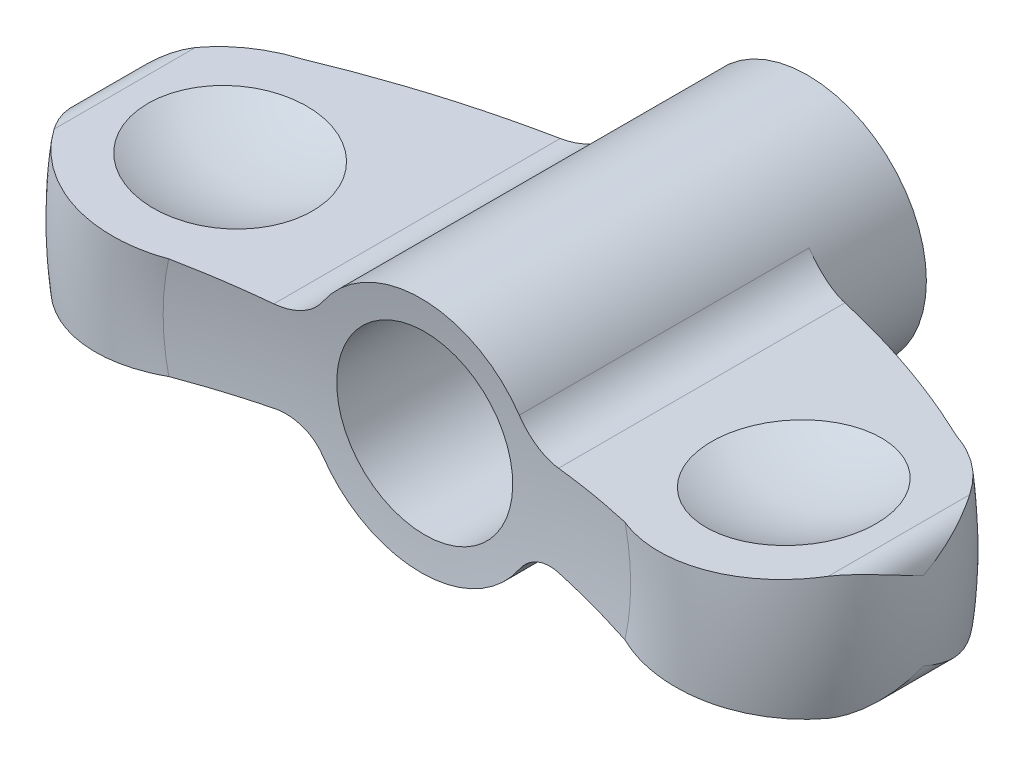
ISO-10303-21;
HEADER;
FILE_DESCRIPTION(('STEP AP214'),'2;1');
FILE_NAME('part.step','',(''),(''),'','','');
FILE_SCHEMA(('AUTOMOTIVE_DESIGN { 1 0 10303 214 1 1 1 1 }'));
ENDSEC;
DATA;
#1=APPLICATION_CONTEXT('core data for automotive mechanical design processes');
#2=APPLICATION_PROTOCOL_DEFINITION('international standard','automotive_design',2000,#1);
#3=PRODUCT_CONTEXT('',#1,'mechanical');
#4=PRODUCT('Part','Part','',(#3));
#5=PRODUCT_RELATED_PRODUCT_CATEGORY('part','',(#4));
#6=PRODUCT_DEFINITION_FORMATION('','',#4);
#7=PRODUCT_DEFINITION_CONTEXT('part definition',#1,'design');
#8=PRODUCT_DEFINITION('design','',#6,#7);
#9=PRODUCT_DEFINITION_SHAPE('','',#8);
#10=(LENGTH_UNIT() NAMED_UNIT(*) SI_UNIT(.MILLI.,.METRE.));
#11=(NAMED_UNIT(*) PLANE_ANGLE_UNIT() SI_UNIT($,.RADIAN.));
#12=(NAMED_UNIT(*) SI_UNIT($,.STERADIAN.) SOLID_ANGLE_UNIT());
#13=UNCERTAINTY_MEASURE_WITH_UNIT(LENGTH_MEASURE(1.E-05),#10,'distance_accuracy_value','');
#14=(GEOMETRIC_REPRESENTATION_CONTEXT(3) GLOBAL_UNCERTAINTY_ASSIGNED_CONTEXT((#13)) GLOBAL_UNIT_ASSIGNED_CONTEXT((#10,
#11,#12)) REPRESENTATION_CONTEXT('',''));
#15=CARTESIAN_POINT('',(0.,0.,0.));
#16=DIRECTION('',(0.,0.,1.));
#17=DIRECTION('',(1.,0.,0.));
#18=AXIS2_PLACEMENT_3D('',#15,#16,#17);
#19=CARTESIAN_POINT('',(0.,0.,16.8));
#20=DIRECTION('',(0.,0.,1.));
#21=DIRECTION('',(5.59811363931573E-11,-1.,0.));
#22=AXIS2_PLACEMENT_3D('',#19,#20,#21);
#23=TOROIDAL_SURFACE('',#22,16.3000000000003,7.2);
#24=CARTESIAN_POINT('',(13.4430070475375,2.92809317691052,10.0635861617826));
#25=CARTESIAN_POINT('',(13.2500457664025,2.91519660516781,10.1357408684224));
#26=CARTESIAN_POINT('',(13.0601324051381,2.90250374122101,10.2160710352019));
#27=CARTESIAN_POINT('',(12.6877100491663,2.87761288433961,10.3924240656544));
#28=CARTESIAN_POINT('',(12.5052008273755,2.86541487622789,10.4884464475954));
#29=CARTESIAN_POINT('',(12.148919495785,2.84160280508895,10.6955091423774));
#30=CARTESIAN_POINT('',(11.9751456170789,2.82998862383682,10.8065463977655));
#31=CARTESIAN_POINT('',(11.6375334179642,2.80742430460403,11.0428740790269));
#32=CARTESIAN_POINT('',(11.4736949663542,2.7964741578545,11.1681643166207));
#33=CARTESIAN_POINT('',(11.1570734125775,2.77531274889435,11.4321870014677));
#34=CARTESIAN_POINT('',(11.0042945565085,2.76510177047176,11.5709245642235));
#35=CARTESIAN_POINT('',(10.7109328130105,2.74549493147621,11.8608983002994));
#36=CARTESIAN_POINT('',(10.5703541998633,2.73609935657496,12.0121388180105));
#37=CARTESIAN_POINT('',(10.3025713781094,2.71820208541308,12.3259661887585));
#38=CARTESIAN_POINT('',(10.1753613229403,2.70969999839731,12.4885480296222));
#39=CARTESIAN_POINT('',(9.93523518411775,2.69365116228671,12.8239887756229));
#40=CARTESIAN_POINT('',(9.82231883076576,2.68610439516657,12.9968474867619));
#41=CARTESIAN_POINT('',(9.61240942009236,2.67207509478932,13.3504168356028));
#42=CARTESIAN_POINT('',(9.51531257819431,2.66558562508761,13.5310655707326));
#43=CARTESIAN_POINT('',(9.33694719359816,2.65366457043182,13.8999735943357));
#44=CARTESIAN_POINT('',(9.25567307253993,2.64823261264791,14.088230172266));
#45=CARTESIAN_POINT('',(9.1095973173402,2.63846963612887,14.4711021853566));
#46=CARTESIAN_POINT('',(9.04479892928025,2.63413883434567,14.6657188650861));
#47=CARTESIAN_POINT('',(8.93227844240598,2.62661852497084,15.0598492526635));
#48=CARTESIAN_POINT('',(8.88455601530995,2.62342899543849,15.2593628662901));
#49=CARTESIAN_POINT('',(8.80746852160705,2.61827685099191,15.6574650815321));
#50=CARTESIAN_POINT('',(8.77773054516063,2.61628931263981,15.8559812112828));
#51=CARTESIAN_POINT('',(8.73529826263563,2.61345335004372,16.2548338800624));
#52=CARTESIAN_POINT('',(8.72260367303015,2.61260490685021,16.4551703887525));
#53=CARTESIAN_POINT('',(8.71437606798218,2.61205501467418,16.8561671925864));
#54=CARTESIAN_POINT('',(8.71884052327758,2.61235339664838,17.0568274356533));
#55=CARTESIAN_POINT('',(8.74488386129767,2.61409400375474,17.457028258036));
#56=CARTESIAN_POINT('',(8.76646264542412,2.61553622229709,17.6565688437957));
#57=CARTESIAN_POINT('',(8.82608238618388,2.61952090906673,18.0500864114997));
#58=CARTESIAN_POINT('',(8.86387061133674,2.6220464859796,18.2441019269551));
#59=CARTESIAN_POINT('',(8.95554073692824,2.6281732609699,18.6283441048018));
#60=CARTESIAN_POINT('',(9.00942811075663,2.63177482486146,18.8185694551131));
#61=CARTESIAN_POINT('',(9.13281555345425,2.64002142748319,19.1937999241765));
#62=CARTESIAN_POINT('',(9.20231107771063,2.64466616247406,19.3788065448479));
#63=CARTESIAN_POINT('',(9.35638258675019,2.6549635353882,19.7424794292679));
#64=CARTESIAN_POINT('',(9.44096421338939,2.66061655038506,19.9211432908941));
#65=CARTESIAN_POINT('',(9.62545322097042,2.67294687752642,20.2726485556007));
#66=CARTESIAN_POINT('',(9.72550696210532,2.67963397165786,20.4454127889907));
#67=CARTESIAN_POINT('',(9.93957002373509,2.69394088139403,20.7821124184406));
#68=CARTESIAN_POINT('',(10.0535844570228,2.70156103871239,20.9460445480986));
#69=CARTESIAN_POINT('',(10.294658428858,2.71767322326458,21.2638986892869));
#70=CARTESIAN_POINT('',(10.4217143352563,2.72616500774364,21.4178234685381));
#71=CARTESIAN_POINT('',(10.6880299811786,2.74396422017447,21.714770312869));
#72=CARTESIAN_POINT('',(10.8272940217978,2.75327193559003,21.8577885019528));
#73=CARTESIAN_POINT('',(11.1201972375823,2.77284812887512,22.1349543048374));
#74=CARTESIAN_POINT('',(11.274084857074,2.78313321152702,22.2688382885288));
#75=CARTESIAN_POINT('',(11.5924511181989,2.80441122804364,22.5232972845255));
#76=CARTESIAN_POINT('',(11.7569299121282,2.81540417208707,22.6438721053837));
#77=CARTESIAN_POINT('',(12.0953583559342,2.83802304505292,22.8709220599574));
#78=CARTESIAN_POINT('',(12.2693100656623,2.84964911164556,22.9773941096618));
#79=CARTESIAN_POINT('',(12.6253835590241,2.87344729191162,23.175449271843));
#80=CARTESIAN_POINT('',(12.8075027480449,2.88561923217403,23.267037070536));
#81=CARTESIAN_POINT('',(13.1810420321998,2.9105847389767,23.4357878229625));
#82=CARTESIAN_POINT('',(13.3725503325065,2.92338420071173,23.5127547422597));
#83=CARTESIAN_POINT('',(13.7613485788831,2.94936954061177,23.6502587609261));
#84=CARTESIAN_POINT('',(13.9586384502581,2.96255541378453,23.7107960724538));
#85=CARTESIAN_POINT('',(14.357615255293,2.98922103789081,23.8149976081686));
#86=CARTESIAN_POINT('',(14.559302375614,3.00270080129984,23.8586611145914));
#87=CARTESIAN_POINT('',(14.9656299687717,3.02985771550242,23.9287762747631));
#88=CARTESIAN_POINT('',(15.1702703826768,3.04353486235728,23.955228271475));
#89=CARTESIAN_POINT('',(15.5810553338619,3.070989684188,23.9907056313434));
#90=CARTESIAN_POINT('',(15.7871999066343,3.08476736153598,23.999730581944));
#91=CARTESIAN_POINT('',(16.1994347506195,3.11231908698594,24.000257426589));
#92=CARTESIAN_POINT('',(16.4055250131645,3.12609313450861,23.9917658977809));
#93=CARTESIAN_POINT('',(16.8162992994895,3.15354724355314,23.9572980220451));
#94=CARTESIAN_POINT('',(17.0209829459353,3.16722727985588,23.9313171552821));
#95=CARTESIAN_POINT('',(17.4273317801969,3.19438561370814,23.8620348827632));
#96=CARTESIAN_POINT('',(17.6289980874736,3.20786398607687,23.8187400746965));
#97=CARTESIAN_POINT('',(18.0267250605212,3.23444607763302,23.7154246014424));
#98=CARTESIAN_POINT('',(18.2228121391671,3.24755156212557,23.6555060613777));
#99=CARTESIAN_POINT('',(18.6091495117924,3.27337242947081,23.5192613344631));
#100=CARTESIAN_POINT('',(18.7994018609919,3.28608794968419,23.4429410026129));
#101=CARTESIAN_POINT('',(19.172892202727,3.31105018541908,23.27434465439));
#102=CARTESIAN_POINT('',(19.3561252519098,3.3232965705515,23.1820576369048));
#103=CARTESIAN_POINT('',(19.7140940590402,3.34722142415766,22.9822113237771));
#104=CARTESIAN_POINT('',(19.8888301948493,3.35889991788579,22.8746527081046));
#105=CARTESIAN_POINT('',(20.2275235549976,3.38153649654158,22.6457025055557));
#106=CARTESIAN_POINT('',(20.3915386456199,3.39249844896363,22.5243968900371));
#107=CARTESIAN_POINT('',(20.708721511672,3.41369737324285,22.2682963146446));
#108=CARTESIAN_POINT('',(20.8618896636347,3.4239343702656,22.1335018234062));
#109=CARTESIAN_POINT('',(21.1559703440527,3.44358925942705,21.8516648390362));
#110=CARTESIAN_POINT('',(21.2969064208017,3.45300872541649,21.7046469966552));
#111=CARTESIAN_POINT('',(21.5657772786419,3.47097871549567,21.39923468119));
#112=CARTESIAN_POINT('',(21.6937203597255,3.4795297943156,21.2408475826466));
#113=CARTESIAN_POINT('',(21.8466005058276,3.48974754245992,21.0342564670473));
#114=CARTESIAN_POINT('',(21.8780226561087,3.49184764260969,20.9907857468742));
#115=CARTESIAN_POINT('',(21.9398602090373,3.49598055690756,20.9031903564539));
#116=CARTESIAN_POINT('',(21.9702765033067,3.49801343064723,20.8590663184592));
#117=CARTESIAN_POINT('',(22.0002000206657,3.50001336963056,20.8146028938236));
#118=B_SPLINE_CURVE_WITH_KNOTS('',3,(#24,#25,#26,#27,#28,#29,#30,#31,#32,#33,#34,#35,#36,#37,
#38,#39,#40,#41,#42,#43,#44,#45,#46,#47,#48,#49,#50,#51,#52,#53,#54,#55,#56,#57,#58,#59,#60,#61,
#62,#63,#64,#65,#66,#67,#68,#69,#70,#71,#72,#73,#74,#75,#76,#77,#78,#79,#80,#81,#82,#83,#84,#85,
#86,#87,#88,#89,#90,#91,#92,#93,#94,#95,#96,#97,#98,#99,#100,#101,#102,#103,#104,#105,#106,#107,
#108,#109,#110,#111,#112,#113,#114,#115,#116,#117),.UNSPECIFIED.,.F.,.F.,(4,2,2,2,2,2,2,2,2,2,2,
2,2,2,2,2,2,2,2,2,2,2,2,2,2,2,2,2,2,2,2,2,2,2,2,2,2,2,2,2,2,2,2,2,2,2,4),(0.,0.619053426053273,
1.23808785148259,1.85699641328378,2.47589680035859,3.09503355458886,3.71438635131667,
4.33346714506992,4.95253625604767,5.56736438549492,6.18197536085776,6.79670733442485,
7.41142748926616,8.01292036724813,8.61440323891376,9.21579745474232,9.81718820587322,
10.4095249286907,11.0020632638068,11.5944292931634,12.1870173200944,12.785599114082,
13.3844007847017,13.9830361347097,14.5818832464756,15.1938756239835,15.8058768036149,
16.4180115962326,17.0299532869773,17.6495959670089,18.2692306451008,18.8888916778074,
19.508540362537,20.1282037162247,20.7476344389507,21.3672253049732,21.9865802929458,
22.602211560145,23.2176234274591,23.8334610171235,24.4492711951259,25.0614231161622,
25.6735537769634,26.2844785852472,26.8950106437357,27.056040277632,27.2169231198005),.UNSPECIFIED.);
#119=CARTESIAN_POINT('',(12.9627653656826,2.89599621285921,23.3370956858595));
#120=VERTEX_POINT('',#119);
#121=CARTESIAN_POINT('',(22.0000000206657,3.50000000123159,20.814900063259));
#122=VERTEX_POINT('',#121);
#123=EDGE_CURVE('E175',#120,#122,#118,.T.);
#124=ORIENTED_EDGE('',*,*,#123,.F.);
#125=CARTESIAN_POINT('',(0.,0.,23.3370956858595));
#126=DIRECTION('',(0.,0.,1.));
#127=DIRECTION('',(5.59811363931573E-11,-1.,0.));
#128=AXIS2_PLACEMENT_3D('',#125,#126,#127);
#129=CIRCLE('',#128,13.2823220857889);
#130=CARTESIAN_POINT('',(12.9627653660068,-2.89599621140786,23.3370956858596));
#131=VERTEX_POINT('',#130);
#132=EDGE_CURVE('E187',#131,#120,#129,.T.);
#133=ORIENTED_EDGE('',*,*,#132,.F.);
#134=CARTESIAN_POINT('',(22.000200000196,-3.50001336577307,20.8146029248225));
#135=CARTESIAN_POINT('',(21.8869659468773,-3.49244536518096,20.9829001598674));
#136=CARTESIAN_POINT('',(21.7665908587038,-3.48440009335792,21.1463645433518));
#137=CARTESIAN_POINT('',(21.5125154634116,-3.46741895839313,21.4625195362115));
#138=CARTESIAN_POINT('',(21.3788160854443,-3.45848315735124,21.6152108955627));
#139=CARTESIAN_POINT('',(21.0991608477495,-3.43979239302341,21.9086013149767));
#140=CARTESIAN_POINT('',(20.9532163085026,-3.43003818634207,22.0493112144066));
#141=CARTESIAN_POINT('',(20.650023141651,-3.40977426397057,22.3179109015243));
#142=CARTESIAN_POINT('',(20.4927745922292,-3.39926455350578,22.4458007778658));
#143=CARTESIAN_POINT('',(20.1680719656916,-3.37756304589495,22.6878898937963));
#144=CARTESIAN_POINT('',(20.0006161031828,-3.36637112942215,22.8020867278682));
#145=CARTESIAN_POINT('',(19.6566594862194,-3.34338278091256,23.0160136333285));
#146=CARTESIAN_POINT('',(19.4801554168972,-3.33158612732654,23.1157383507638));
#147=CARTESIAN_POINT('',(19.1195107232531,-3.30748243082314,23.2999405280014));
#148=CARTESIAN_POINT('',(18.9353740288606,-3.29517565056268,23.3844257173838));
#149=CARTESIAN_POINT('',(18.5606181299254,-3.27012883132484,23.5376689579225));
#150=CARTESIAN_POINT('',(18.3699965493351,-3.25738863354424,23.6064211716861));
#151=CARTESIAN_POINT('',(17.983036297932,-3.23152613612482,23.7279050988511));
#152=CARTESIAN_POINT('',(17.7866806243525,-3.21840270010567,23.7805824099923));
#153=CARTESIAN_POINT('',(17.390183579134,-3.19190281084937,23.8692781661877));
#154=CARTESIAN_POINT('',(17.1900408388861,-3.1785262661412,23.9052904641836));
#155=CARTESIAN_POINT('',(16.7874574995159,-3.15161959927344,23.9604036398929));
#156=CARTESIAN_POINT('',(16.585016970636,-3.13808948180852,23.9795050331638));
#157=CARTESIAN_POINT('',(16.1792478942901,-3.11096989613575,24.0006952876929));
#158=CARTESIAN_POINT('',(15.9759193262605,-3.09738042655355,24.0027837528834));
#159=CARTESIAN_POINT('',(15.5684666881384,-3.07014831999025,23.9899203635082));
#160=CARTESIAN_POINT('',(15.3643461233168,-3.05650591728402,23.9748568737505));
#161=CARTESIAN_POINT('',(14.9580777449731,-3.0293529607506,23.9276425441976));
#162=CARTESIAN_POINT('',(14.7559299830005,-3.01584241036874,23.8954912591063));
#163=CARTESIAN_POINT('',(14.3550670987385,-2.98905073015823,23.8143605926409));
#164=CARTESIAN_POINT('',(14.1563513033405,-2.97576955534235,23.7653845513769));
#165=CARTESIAN_POINT('',(13.763633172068,-2.94952222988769,23.6509482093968));
#166=CARTESIAN_POINT('',(13.5696323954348,-2.93655618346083,23.5854825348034));
#167=CARTESIAN_POINT('',(13.1865164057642,-2.91095061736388,23.4380671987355));
#168=CARTESIAN_POINT('',(12.9974412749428,-2.89831377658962,23.3560128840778));
#169=CARTESIAN_POINT('',(12.6268363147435,-2.8735443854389,23.1762764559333));
#170=CARTESIAN_POINT('',(12.4453065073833,-2.861411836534,23.0785942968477));
#171=CARTESIAN_POINT('',(12.0910342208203,-2.83773404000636,22.8682633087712));
#172=CARTESIAN_POINT('',(11.9182938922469,-2.82618893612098,22.7556108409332));
#173=CARTESIAN_POINT('',(11.5829402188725,-2.80377556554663,22.5161828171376));
#174=CARTESIAN_POINT('',(11.420323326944,-2.79290706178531,22.3894122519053));
#175=CARTESIAN_POINT('',(11.1059013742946,-2.77189266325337,22.1222291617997));
#176=CARTESIAN_POINT('',(10.9541266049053,-2.7617487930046,21.9817808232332));
#177=CARTESIAN_POINT('',(10.6630509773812,-2.74229474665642,21.6885550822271));
#178=CARTESIAN_POINT('',(10.5237454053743,-2.73298425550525,21.5357823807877));
#179=CARTESIAN_POINT('',(10.2585504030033,-2.71525994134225,21.2188580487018));
#180=CARTESIAN_POINT('',(10.1326659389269,-2.70684645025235,21.0547022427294));
#181=CARTESIAN_POINT('',(9.89540453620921,-2.69098907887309,20.7162706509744));
#182=CARTESIAN_POINT('',(9.7840218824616,-2.68354481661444,20.5419988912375));
#183=CARTESIAN_POINT('',(9.57753567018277,-2.66974430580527,20.1860989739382));
#184=CARTESIAN_POINT('',(9.48229586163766,-2.66337895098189,20.0045502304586));
#185=CARTESIAN_POINT('',(9.30772151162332,-2.65171127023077,19.6340070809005));
#186=CARTESIAN_POINT('',(9.22838099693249,-2.64640854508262,19.4450155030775));
#187=CARTESIAN_POINT('',(9.08624438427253,-2.63690884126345,19.0608700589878));
#188=CARTESIAN_POINT('',(9.02344908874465,-2.63271191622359,18.8657158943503));
#189=CARTESIAN_POINT('',(8.91497467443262,-2.62546202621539,18.4706862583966));
#190=CARTESIAN_POINT('',(8.86929523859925,-2.62240904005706,18.2708108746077));
#191=CARTESIAN_POINT('',(8.79627719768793,-2.61752887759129,17.8722020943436));
#192=CARTESIAN_POINT('',(8.7685625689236,-2.61567656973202,17.6735378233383));
#193=CARTESIAN_POINT('',(8.73017446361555,-2.61311089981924,17.2745631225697));
#194=CARTESIAN_POINT('',(8.71950071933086,-2.61239751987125,17.0742527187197));
#195=CARTESIAN_POINT('',(8.71529310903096,-2.61211630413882,16.673466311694));
#196=CARTESIAN_POINT('',(8.72175798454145,-2.6125483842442,16.4729903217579));
#197=CARTESIAN_POINT('',(8.75176494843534,-2.61455390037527,16.0733272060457));
#198=CARTESIAN_POINT('',(8.77530694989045,-2.61612733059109,15.8741400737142));
#199=CARTESIAN_POINT('',(8.83878915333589,-2.62037016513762,15.4813635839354));
#200=CARTESIAN_POINT('',(8.87848770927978,-2.62302341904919,15.2877349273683));
#201=CARTESIAN_POINT('',(8.9739310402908,-2.62940237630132,14.9044232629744));
#202=CARTESIAN_POINT('',(9.02968125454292,-2.63312844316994,14.7147416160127));
#203=CARTESIAN_POINT('',(9.15673580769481,-2.64162013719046,14.3407362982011));
#204=CARTESIAN_POINT('',(9.22803659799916,-2.64638552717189,14.1564114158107));
#205=CARTESIAN_POINT('',(9.38562068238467,-2.6569176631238,13.7943056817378));
#206=CARTESIAN_POINT('',(9.4719045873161,-2.66268444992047,13.6165250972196));
#207=CARTESIAN_POINT('',(9.65980249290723,-2.67524261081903,13.266777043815));
#208=CARTESIAN_POINT('',(9.76157423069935,-2.68204452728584,13.0948947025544));
#209=CARTESIAN_POINT('',(9.97895442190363,-2.69657313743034,12.7601587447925));
#210=CARTESIAN_POINT('',(10.0945629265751,-2.70429983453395,12.5973051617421));
#211=CARTESIAN_POINT('',(10.338828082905,-2.7206253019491,12.2815998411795));
#212=CARTESIAN_POINT('',(10.4674919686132,-2.72922455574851,12.1287537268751));
#213=CARTESIAN_POINT('',(10.7368892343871,-2.74722972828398,11.83415215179));
#214=CARTESIAN_POINT('',(10.8776225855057,-2.75663564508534,11.6923966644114));
#215=CARTESIAN_POINT('',(11.1735584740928,-2.77641452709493,11.4177499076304));
#216=CARTESIAN_POINT('',(11.3290201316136,-2.78680481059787,11.2851390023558));
#217=CARTESIAN_POINT('',(11.6503816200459,-2.80828301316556,11.0334204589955));
#218=CARTESIAN_POINT('',(11.816277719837,-2.81937068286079,10.9143080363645));
#219=CARTESIAN_POINT('',(12.1571151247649,-2.8421505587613,10.6905168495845));
#220=CARTESIAN_POINT('',(12.3320419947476,-2.85384180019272,10.5858159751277));
#221=CARTESIAN_POINT('',(12.6898958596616,-2.87775897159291,10.3913862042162));
#222=CARTESIAN_POINT('',(12.872818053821,-2.88998458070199,10.3016484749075));
#223=CARTESIAN_POINT('',(13.1223586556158,-2.9066626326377,10.1918600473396));
#224=CARTESIAN_POINT('',(13.186021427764,-2.91091753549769,10.1649193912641));
#225=CARTESIAN_POINT('',(13.3140099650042,-2.91947165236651,10.1128788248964));
#226=CARTESIAN_POINT('',(13.3783349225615,-2.92377081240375,10.0877769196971));
#227=CARTESIAN_POINT('',(13.4430070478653,-2.92809317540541,10.0635861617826));
#228=B_SPLINE_CURVE_WITH_KNOTS('',3,(#134,#135,#136,#137,#138,#139,#140,#141,#142,#143,#144,
#145,#146,#147,#148,#149,#150,#151,#152,#153,#154,#155,#156,#157,#158,#159,#160,#161,#162,#163,
#164,#165,#166,#167,#168,#169,#170,#171,#172,#173,#174,#175,#176,#177,#178,#179,#180,#181,#182,
#183,#184,#185,#186,#187,#188,#189,#190,#191,#192,#193,#194,#195,#196,#197,#198,#199,#200,#201,
#202,#203,#204,#205,#206,#207,#208,#209,#210,#211,#212,#213,#214,#215,#216,#217,#218,#219,#220,
#221,#222,#223,#224,#225,#226,#227),.UNSPECIFIED.,.F.,.F.,(4,2,2,2,2,2,2,2,2,2,2,2,2,2,2,2,2,2,
2,2,2,2,2,2,2,2,2,2,2,2,2,2,2,2,2,2,2,2,2,2,2,2,2,2,2,2,4),(0.,0.608767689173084,
1.21749295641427,1.82566153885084,2.43382591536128,3.04209697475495,3.65059249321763,
4.25877850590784,4.86718980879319,5.47763788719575,6.0883109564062,6.69896540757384,
7.30963407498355,7.92430017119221,8.53898228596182,9.15354244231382,9.76830314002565,
10.3870705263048,11.0058397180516,11.6247595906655,12.2434613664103,12.8638290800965,
13.4839612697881,14.1043221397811,14.7244377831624,15.3390262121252,15.9533833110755,
16.5677702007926,17.1821457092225,17.7832066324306,18.3842581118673,18.9852654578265,
19.5862697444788,20.1785973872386,20.7711259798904,21.3635195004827,21.9559371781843,
22.554851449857,23.1537679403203,23.7530181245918,24.3522668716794,24.9653566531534,
25.5782284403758,26.1901492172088,26.8017074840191,27.0094652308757,27.2169941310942),.UNSPECIFIED.);
#229=CARTESIAN_POINT('',(22.0000000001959,-3.49999999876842,20.8149000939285));
#230=VERTEX_POINT('',#229);
#231=EDGE_CURVE('E289',#230,#131,#228,.T.);
#232=ORIENTED_EDGE('',*,*,#231,.F.);
#233=CARTESIAN_POINT('',(23.39366515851,-2.23303167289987,16.8));
#234=CARTESIAN_POINT('',(23.3934426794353,-2.23536251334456,16.8051493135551));
#235=CARTESIAN_POINT('',(23.3932143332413,-2.23769289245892,16.8102988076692));
#236=CARTESIAN_POINT('',(23.3743145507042,-2.42570444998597,17.2258528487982));
#237=CARTESIAN_POINT('',(23.3183956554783,-2.60830531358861,17.6373544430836));
#238=CARTESIAN_POINT('',(23.1798743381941,-2.8596587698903,18.2505518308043));
#239=CARTESIAN_POINT('',(23.1245479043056,-2.93972311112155,18.4543861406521));
#240=CARTESIAN_POINT('',(22.9956909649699,-3.0890981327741,18.8603432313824));
#241=CARTESIAN_POINT('',(22.9221687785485,-3.15841370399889,19.062466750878));
#242=CARTESIAN_POINT('',(22.7850793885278,-3.26116367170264,19.395929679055));
#243=CARTESIAN_POINT('',(22.7265638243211,-3.29880232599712,19.5280746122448));
#244=CARTESIAN_POINT('',(22.6018254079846,-3.36602668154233,19.7906656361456));
#245=CARTESIAN_POINT('',(22.5356088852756,-3.39561893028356,19.9211130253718));
#246=CARTESIAN_POINT('',(22.3953169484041,-3.44509635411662,20.1805136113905));
#247=CARTESIAN_POINT('',(22.321205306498,-3.46493421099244,20.3094566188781));
#248=CARTESIAN_POINT('',(22.2046559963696,-3.48552373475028,20.5007658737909));
#249=CARTESIAN_POINT('',(22.1648550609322,-3.49085996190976,20.5642643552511));
#250=CARTESIAN_POINT('',(22.0835651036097,-3.49809815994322,20.6904076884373));
#251=CARTESIAN_POINT('',(22.042075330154,-3.49999858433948,20.7530521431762));
#252=CARTESIAN_POINT('',(21.999800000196,-3.49999998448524,20.8151941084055));
#253=B_SPLINE_CURVE_WITH_KNOTS('',3,(#233,#234,#235,#236,#237,#238,#239,#240,#241,#242,#243,
#244,#245,#246,#247,#248,#249,#250,#251,#252),.UNSPECIFIED.,.F.,.F.,(4,2,2,2,2,2,2,2,2,4),(0.,
0.016970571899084,1.36944581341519,2.04642868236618,2.72310260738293,3.1707723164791,
3.61807665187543,4.06752994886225,4.2928318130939,4.51823506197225),.UNSPECIFIED.);
#254=CARTESIAN_POINT('',(23.3936651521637,-2.23303173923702,16.8));
#255=VERTEX_POINT('',#254);
#256=EDGE_CURVE('E346',#255,#230,#253,.T.);
#257=ORIENTED_EDGE('',*,*,#256,.F.);
#258=CARTESIAN_POINT('',(21.999800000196,-3.4999999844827,12.784805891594));
#259=CARTESIAN_POINT('',(22.0666741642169,-3.49996243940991,12.8830879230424));
#260=CARTESIAN_POINT('',(22.1315514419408,-3.49523252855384,12.9826100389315));
#261=CARTESIAN_POINT('',(22.2568815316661,-3.47769367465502,13.183511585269));
#262=CARTESIAN_POINT('',(22.317340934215,-3.46489705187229,13.2848879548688));
#263=CARTESIAN_POINT('',(22.4333648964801,-3.43259082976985,13.4887461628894));
#264=CARTESIAN_POINT('',(22.4889490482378,-3.41310980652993,13.5912215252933));
#265=CARTESIAN_POINT('',(22.5953729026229,-3.36841026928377,13.7974289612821));
#266=CARTESIAN_POINT('',(22.6462099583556,-3.34318858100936,13.901161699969));
#267=CARTESIAN_POINT('',(22.7740899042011,-3.2701146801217,14.1765334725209));
#268=CARTESIAN_POINT('',(22.8470051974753,-3.21812877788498,14.3490158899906));
#269=CARTESIAN_POINT('',(22.9794561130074,-3.10414337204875,14.6957451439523));
#270=CARTESIAN_POINT('',(23.0389856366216,-3.04213932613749,14.8699927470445));
#271=CARTESIAN_POINT('',(23.1975205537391,-2.84462859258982,15.3951794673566));
#272=CARTESIAN_POINT('',(23.276328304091,-2.69771476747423,15.7482515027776));
#273=CARTESIAN_POINT('',(23.3443046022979,-2.49442989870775,16.2153989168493));
#274=CARTESIAN_POINT('',(23.358023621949,-2.44419371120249,16.3292368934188));
#275=CARTESIAN_POINT('',(23.3797700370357,-2.34273549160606,16.5569077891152));
#276=CARTESIAN_POINT('',(23.3878040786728,-2.29151468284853,16.6707405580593));
#277=CARTESIAN_POINT('',(23.3932143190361,-2.23769296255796,16.7897010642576));
#278=CARTESIAN_POINT('',(23.3934426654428,-2.23536258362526,16.7948505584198));
#279=CARTESIAN_POINT('',(23.39366515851,-2.23303167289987,16.8));
#280=B_SPLINE_CURVE_WITH_KNOTS('',3,(#258,#259,#260,#261,#262,#263,#264,#265,#266,#267,#268,
#269,#270,#271,#272,#273,#274,#275,#276,#277,#278,#279),.UNSPECIFIED.,.F.,.F.,(4,2,2,2,2,2,2,2,
2,2,4),(0.,0.356372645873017,0.712202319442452,1.06652937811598,1.42105283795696,
2.00316709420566,2.58554603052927,3.75135617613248,4.12686584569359,4.50193578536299,
4.51890635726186),.UNSPECIFIED.);
#281=CARTESIAN_POINT('',(22.0000000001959,-3.49999999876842,12.7850999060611));
#282=VERTEX_POINT('',#281);
#283=EDGE_CURVE('E339',#282,#255,#280,.T.);
#284=ORIENTED_EDGE('',*,*,#283,.F.);
#285=CARTESIAN_POINT('',(18.5559048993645,-3.26981382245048,10.0635861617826));
#286=CARTESIAN_POINT('',(18.7481532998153,-3.28266274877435,10.1358408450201));
#287=CARTESIAN_POINT('',(18.9373210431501,-3.29530577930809,10.2163336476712));
#288=CARTESIAN_POINT('',(19.3081618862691,-3.32009093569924,10.3931469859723));
#289=CARTESIAN_POINT('',(19.4898343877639,-3.33223302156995,10.4894687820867));
#290=CARTESIAN_POINT('',(19.8398224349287,-3.35562448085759,10.6946430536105));
#291=CARTESIAN_POINT('',(20.0083599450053,-3.3668886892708,10.8031155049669));
#292=CARTESIAN_POINT('',(20.3358278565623,-3.38877501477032,11.0337190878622));
#293=CARTESIAN_POINT('',(20.494759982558,-3.39939724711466,11.1558477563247));
#294=CARTESIAN_POINT('',(20.7764213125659,-3.41822208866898,11.3915935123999));
#295=CARTESIAN_POINT('',(20.9007819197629,-3.42653373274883,11.5032605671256));
#296=CARTESIAN_POINT('',(21.1414563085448,-3.44261921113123,11.7349898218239));
#297=CARTESIAN_POINT('',(21.2577703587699,-3.45039306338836,11.8550517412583));
#298=CARTESIAN_POINT('',(21.4842055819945,-3.46552686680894,12.1056865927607));
#299=CARTESIAN_POINT('',(21.5941379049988,-3.47287419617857,12.236430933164));
#300=CARTESIAN_POINT('',(21.8044661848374,-3.48693149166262,12.5054420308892));
#301=CARTESIAN_POINT('',(21.9048606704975,-3.49364135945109,12.6437099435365));
#302=CARTESIAN_POINT('',(22.000200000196,-3.50001336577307,12.7853970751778));
#303=B_SPLINE_CURVE_WITH_KNOTS('',3,(#285,#286,#287,#288,#289,#290,#291,#292,#293,#294,#295,
#296,#297,#298,#299,#300,#301,#302),.UNSPECIFIED.,.F.,.F.,(4,2,2,2,2,2,2,2,4),(0.,
0.617158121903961,1.23436541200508,1.83590974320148,2.43734575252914,2.93898887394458,
3.44061523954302,3.95311321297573,4.46569010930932),.UNSPECIFIED.);
#304=CARTESIAN_POINT('',(18.5564367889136,-3.26984937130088,10.0637861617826));
#305=VERTEX_POINT('',#304);
#306=EDGE_CURVE('E280',#305,#282,#303,.T.);
#307=ORIENTED_EDGE('',*,*,#306,.F.);
#308=CARTESIAN_POINT('',(0.,0.,10.0637861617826));
#309=DIRECTION('',(0.,0.,1.));
#310=DIRECTION('',(5.59811363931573E-11,-1.,0.));
#311=AXIS2_PLACEMENT_3D('',#308,#309,#310);
#312=CIRCLE('',#311,18.8423263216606);
#313=CARTESIAN_POINT('',(18.5564367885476,3.2698493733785,10.0637861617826));
#314=VERTEX_POINT('',#313);
#315=EDGE_CURVE('E183',#305,#314,#312,.T.);
#316=ORIENTED_EDGE('',*,*,#315,.T.);
#317=CARTESIAN_POINT('',(22.0002000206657,3.50001336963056,12.7853971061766));
#318=CARTESIAN_POINT('',(21.8855721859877,3.49235221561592,12.6150255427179));
#319=CARTESIAN_POINT('',(21.7636225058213,3.48420170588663,12.4496052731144));
#320=CARTESIAN_POINT('',(21.506066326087,3.46698793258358,12.1298039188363));
#321=CARTESIAN_POINT('',(21.3704594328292,3.45792464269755,11.9754231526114));
#322=CARTESIAN_POINT('',(21.0901761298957,3.43919190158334,11.6826018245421));
#323=CARTESIAN_POINT('',(20.9458162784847,3.42954360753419,11.543856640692));
#324=CARTESIAN_POINT('',(20.6460984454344,3.40951195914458,11.2788991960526));
#325=CARTESIAN_POINT('',(20.4907422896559,3.39912872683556,11.1526848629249));
#326=CARTESIAN_POINT('',(20.1963110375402,3.3794504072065,10.933163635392));
#327=CARTESIAN_POINT('',(20.0587202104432,3.37025452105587,10.8378487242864));
#328=CARTESIAN_POINT('',(19.7772660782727,3.3514435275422,10.6570247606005));
#329=CARTESIAN_POINT('',(19.6334029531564,3.34182843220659,10.5715154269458));
#330=CARTESIAN_POINT('',(19.3369202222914,3.32201300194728,10.4089623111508));
#331=CARTESIAN_POINT('',(19.184178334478,3.31180449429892,10.3321425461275));
#332=CARTESIAN_POINT('',(18.8736362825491,3.29104940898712,10.1895126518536));
#333=CARTESIAN_POINT('',(18.7158354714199,3.28050278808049,10.1237039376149));
#334=CARTESIAN_POINT('',(18.5559048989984,3.26981382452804,10.0635861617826));
#335=B_SPLINE_CURVE_WITH_KNOTS('',3,(#317,#318,#319,#320,#321,#322,#323,#324,#325,#326,#327,
#328,#329,#330,#331,#332,#333,#334),.UNSPECIFIED.,.F.,.F.,(4,2,2,2,2,2,2,2,4),(0.,
0.616269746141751,1.23255726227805,1.83324114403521,2.43382551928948,2.93633271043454,
3.43882549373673,3.9522243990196,4.46568922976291),.UNSPECIFIED.);
#336=CARTESIAN_POINT('',(22.0000000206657,3.50000000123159,12.7850999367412));
#337=VERTEX_POINT('',#336);
#338=EDGE_CURVE('E297',#337,#314,#335,.T.);
#339=ORIENTED_EDGE('',*,*,#338,.F.);
#340=CARTESIAN_POINT('',(23.39366515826,2.23303167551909,16.8));
#341=CARTESIAN_POINT('',(23.3934426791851,2.2353625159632,16.7948506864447));
#342=CARTESIAN_POINT('',(23.3932143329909,2.237692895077,16.7897011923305));
#343=CARTESIAN_POINT('',(23.3743145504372,2.42570445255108,16.3741471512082));
#344=CARTESIAN_POINT('',(23.3183956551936,2.60830531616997,15.9626455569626));
#345=CARTESIAN_POINT('',(23.1798743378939,2.85965877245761,15.3494481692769));
#346=CARTESIAN_POINT('',(23.1245479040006,2.93972311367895,15.1456138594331));
#347=CARTESIAN_POINT('',(22.9956909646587,3.08909813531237,14.7396567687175));
#348=CARTESIAN_POINT('',(22.9221687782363,3.15841370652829,14.5375332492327));
#349=CARTESIAN_POINT('',(22.7850793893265,3.26116367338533,14.2040703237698));
#350=CARTESIAN_POINT('',(22.7265638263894,3.29880232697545,14.071925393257));
#351=CARTESIAN_POINT('',(22.6018254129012,3.36602668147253,13.809334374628));
#352=CARTESIAN_POINT('',(22.5356088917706,3.39561892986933,13.6788869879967));
#353=CARTESIAN_POINT('',(22.3953169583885,3.44509635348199,13.4194864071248));
#354=CARTESIAN_POINT('',(22.3212053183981,3.46493421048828,13.2905434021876));
#355=CARTESIAN_POINT('',(22.2046560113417,3.48552373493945,13.0992341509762));
#356=CARTESIAN_POINT('',(22.1648550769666,3.49085996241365,13.0357356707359));
#357=CARTESIAN_POINT('',(22.0835651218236,3.49809816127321,12.9095923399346));
#358=CARTESIAN_POINT('',(22.0420753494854,3.49999858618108,12.8469478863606));
#359=CARTESIAN_POINT('',(21.9998000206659,3.49999998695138,12.7848059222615));
#360=B_SPLINE_CURVE_WITH_KNOTS('',3,(#340,#341,#342,#343,#344,#345,#346,#347,#348,#349,#350,
#351,#352,#353,#354,#355,#356,#357,#358,#359),.UNSPECIFIED.,.F.,.F.,(4,2,2,2,2,2,2,2,2,4),(0.,
0.0169705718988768,1.36944581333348,2.04642868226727,2.72310260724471,3.17077230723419,
3.61807663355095,4.06752992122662,4.29283178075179,4.51823502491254),.UNSPECIFIED.);
#361=CARTESIAN_POINT('',(23.393665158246,2.23303167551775,16.8));
#362=VERTEX_POINT('',#361);
#363=EDGE_CURVE('E9',#362,#337,#360,.T.);
#364=ORIENTED_EDGE('',*,*,#363,.F.);
#365=CARTESIAN_POINT('',(21.9998000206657,3.49999998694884,20.8151940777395));
#366=CARTESIAN_POINT('',(22.0666741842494,3.49996244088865,20.7169120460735));
#367=CARTESIAN_POINT('',(22.1315514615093,3.49523252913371,20.6173899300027));
#368=CARTESIAN_POINT('',(22.2568815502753,3.47769367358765,20.4164883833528));
#369=CARTESIAN_POINT('',(22.3173409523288,3.46489705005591,20.3151120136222));
#370=CARTESIAN_POINT('',(22.4333649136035,3.43259082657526,20.1112538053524));
#371=CARTESIAN_POINT('',(22.4889490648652,3.41310980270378,20.0087784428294));
#372=CARTESIAN_POINT('',(22.5953729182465,3.36841026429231,19.8025710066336));
#373=CARTESIAN_POINT('',(22.6462099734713,3.34318857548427,19.6988382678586));
#374=CARTESIAN_POINT('',(22.774089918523,3.27011467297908,19.4234664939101));
#375=CARTESIAN_POINT('',(22.8470052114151,3.21812876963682,19.2509840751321));
#376=CARTESIAN_POINT('',(22.979456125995,3.10414336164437,18.9042548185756));
#377=CARTESIAN_POINT('',(23.0389856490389,3.04213931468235,18.7300072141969));
#378=CARTESIAN_POINT('',(23.1975205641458,2.84462857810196,18.2048204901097));
#379=CARTESIAN_POINT('',(23.2763283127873,2.6977147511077,17.8517484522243));
#380=CARTESIAN_POINT('',(23.3443046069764,2.4944298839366,17.3846010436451));
#381=CARTESIAN_POINT('',(23.3580236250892,2.44419369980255,17.2707630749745));
#382=CARTESIAN_POINT('',(23.3797700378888,2.3427354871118,17.0430921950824));
#383=CARTESIAN_POINT('',(23.3878040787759,2.29151468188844,16.9292594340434));
#384=CARTESIAN_POINT('',(23.3932143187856,2.23769296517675,16.8102989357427));
#385=CARTESIAN_POINT('',(23.3934426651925,2.23536258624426,16.8051494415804));
#386=CARTESIAN_POINT('',(23.39366515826,2.23303167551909,16.8));
#387=B_SPLINE_CURVE_WITH_KNOTS('',3,(#365,#366,#367,#368,#369,#370,#371,#372,#373,#374,#375,
#376,#377,#378,#379,#380,#381,#382,#383,#384,#385,#386),.UNSPECIFIED.,.F.,.F.,(4,2,2,2,2,2,2,2,
2,2,4),(0.,0.356372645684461,0.712202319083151,1.06652937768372,1.42105283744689,
2.00316709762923,2.58554603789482,3.75135619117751,4.12686583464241,4.50193574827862,
4.51890632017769),.UNSPECIFIED.);
#388=EDGE_CURVE('E28',#122,#362,#387,.T.);
#389=ORIENTED_EDGE('',*,*,#388,.F.);
#390=EDGE_LOOP('',(#124,#133,#232,#257,#284,#307,#316,#339,#364,#389));
#391=FACE_BOUND('',#390,.T.);
#392=ADVANCED_FACE('F14',(#391),#23,.T.);
#393=CARTESIAN_POINT('',(0.,0.,60.8916836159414));
#394=DIRECTION('',(0.,0.,1.));
#395=DIRECTION('',(5.59811363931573E-11,-1.,0.));
#396=AXIS2_PLACEMENT_3D('',#393,#394,#395);
#397=DEGENERATE_TOROIDAL_SURFACE('',#396,7.24809636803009,57.1330492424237,.F.);
#398=CARTESIAN_POINT('',(0.,0.,5.5));
#399=DIRECTION('',(0.,0.,1.));
#400=DIRECTION('',(5.59811363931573E-11,-1.,0.));
#401=AXIS2_PLACEMENT_3D('',#398,#399,#400);
#402=CIRCLE('',#401,6.75);
#403=CARTESIAN_POINT('',(-5.58468393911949,3.79128016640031,5.5));
#404=VERTEX_POINT('',#403);
#405=CARTESIAN_POINT('',(-5.58468393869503,-3.79128016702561,5.5));
#406=VERTEX_POINT('',#405);
#407=EDGE_CURVE('E162',#404,#406,#402,.T.);
#408=ORIENTED_EDGE('',*,*,#407,.T.);
#409=CARTESIAN_POINT('',(-5.58454817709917,-3.79148016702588,5.50000000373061));
#410=CARTESIAN_POINT('',(-5.62703500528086,-3.72886637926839,5.49999203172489));
#411=CARTESIAN_POINT('',(-5.67207292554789,-3.66799067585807,5.50109190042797));
#412=CARTESIAN_POINT('',(-5.76687239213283,-3.55013742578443,5.5054646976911));
#413=CARTESIAN_POINT('',(-5.81663303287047,-3.49315913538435,5.5087372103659));
#414=CARTESIAN_POINT('',(-5.92037232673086,-3.38365000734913,5.51740071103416));
#415=CARTESIAN_POINT('',(-5.974338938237,-3.33110730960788,5.5227858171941));
#416=CARTESIAN_POINT('',(-6.0861731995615,-3.23065312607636,5.53558959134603));
#417=CARTESIAN_POINT('',(-6.14404090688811,-3.18274170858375,5.54300828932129));
#418=CARTESIAN_POINT('',(-6.32281948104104,-3.04645743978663,5.56816484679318));
#419=CARTESIAN_POINT('',(-6.44903201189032,-2.96540189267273,5.58881397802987));
#420=CARTESIAN_POINT('',(-6.71175482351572,-2.82481579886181,5.63683026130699));
#421=CARTESIAN_POINT('',(-6.84827321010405,-2.76530241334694,5.66420274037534));
#422=CARTESIAN_POINT('',(-7.13180529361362,-2.66747892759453,5.72532830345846));
#423=CARTESIAN_POINT('',(-7.27900617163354,-2.62981214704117,5.75923917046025));
#424=CARTESIAN_POINT('',(-7.57631968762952,-2.5788044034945,5.83159976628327));
#425=CARTESIAN_POINT('',(-7.726428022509,-2.56542990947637,5.87004316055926));
#426=CARTESIAN_POINT('',(-7.91146899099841,-2.56375196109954,5.9195986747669));
#427=CARTESIAN_POINT('',(-7.94691227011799,-2.56410633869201,5.92918950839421));
#428=CARTESIAN_POINT('',(-8.01766035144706,-2.56615563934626,5.94852854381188));
#429=CARTESIAN_POINT('',(-8.05296528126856,-2.56784856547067,5.958276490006));
#430=CARTESIAN_POINT('',(-8.0882150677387,-2.57020553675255,5.96810530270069));
#431=B_SPLINE_CURVE_WITH_KNOTS('',3,(#409,#410,#411,#412,#413,#414,#415,#416,#417,#418,#419,
#420,#421,#422,#423,#424,#425,#426,#427,#428,#429,#430),.UNSPECIFIED.,.F.,.F.,(4,2,2,2,2,2,2,2,
2,2,4),(0.,0.226923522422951,0.453803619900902,0.680056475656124,0.906312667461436,
1.35828167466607,1.81060994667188,2.27565813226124,2.74006391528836,2.85020967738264,
2.96019142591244),.UNSPECIFIED.);
#432=CARTESIAN_POINT('',(-8.0880150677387,-2.57019216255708,5.96804953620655));
#433=VERTEX_POINT('',#432);
#434=EDGE_CURVE('E151',#406,#433,#431,.T.);
#435=ORIENTED_EDGE('',*,*,#434,.T.);
#436=CARTESIAN_POINT('',(-18.5568278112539,-3.26987550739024,10.0639861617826));
#437=CARTESIAN_POINT('',(-17.7202118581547,-3.21396026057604,9.63606709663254));
#438=CARTESIAN_POINT('',(-16.8730027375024,-3.15733701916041,9.22898268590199));
#439=CARTESIAN_POINT('',(-15.1615683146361,-3.04295325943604,8.45851890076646));
#440=CARTESIAN_POINT('',(-14.2973907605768,-2.98519593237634,8.09503297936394));
#441=CARTESIAN_POINT('',(-12.5519653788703,-2.868540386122,7.4116445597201));
#442=CARTESIAN_POINT('',(-11.6707170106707,-2.80964213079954,7.09174344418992));
#443=CARTESIAN_POINT('',(-10.3366076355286,-2.72047689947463,6.64515483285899));
#444=CARTESIAN_POINT('',(-9.88928279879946,-2.69057993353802,6.50167304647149));
#445=CARTESIAN_POINT('',(-8.99112522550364,-2.63055155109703,6.22618011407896));
#446=CARTESIAN_POINT('',(-8.54029244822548,-2.60042013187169,6.0941691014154));
#447=CARTESIAN_POINT('',(-8.0878150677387,-2.5701787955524,5.96799377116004));
#448=B_SPLINE_CURVE_WITH_KNOTS('',3,(#436,#437,#438,#439,#440,#441,#442,#443,#444,#445,#446,
#447),.UNSPECIFIED.,.F.,.F.,(4,2,2,2,2,4),(0.,2.82377208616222,5.64049635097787,
8.45730995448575,9.86934742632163,11.2814013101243),.UNSPECIFIED.);
#449=CARTESIAN_POINT('',(-18.5564367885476,-3.2698493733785,10.0637861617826));
#450=VERTEX_POINT('',#449);
#451=EDGE_CURVE('E210',#450,#433,#448,.T.);
#452=ORIENTED_EDGE('',*,*,#451,.F.);
#453=CARTESIAN_POINT('',(-18.5564367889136,3.26984937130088,10.0637861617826));
#454=VERTEX_POINT('',#453);
#455=EDGE_CURVE('E182',#454,#450,#312,.T.);
#456=ORIENTED_EDGE('',*,*,#455,.F.);
#457=CARTESIAN_POINT('',(-8.08781506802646,2.57017879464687,5.96799377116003));
#458=CARTESIAN_POINT('',(-8.43648524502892,2.59348217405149,6.06521586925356));
#459=CARTESIAN_POINT('',(-8.78418982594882,2.61672101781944,6.16591362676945));
#460=CARTESIAN_POINT('',(-9.47752423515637,2.66306003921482,6.37414417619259));
#461=CARTESIAN_POINT('',(-9.8231542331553,2.68616022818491,6.48167640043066));
#462=CARTESIAN_POINT('',(-10.8568675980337,2.75524848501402,6.81439605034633));
#463=CARTESIAN_POINT('',(-11.5417095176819,2.8010199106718,7.04968835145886));
#464=CARTESIAN_POINT('',(-13.5766416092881,2.93702464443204,7.7931914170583));
#465=CARTESIAN_POINT('',(-14.9128146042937,3.02632779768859,8.34061833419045));
#466=CARTESIAN_POINT('',(-16.618242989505,3.14031014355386,9.11672807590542));
#467=CARTESIAN_POINT('',(-17.0086949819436,3.16640601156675,9.29983650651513));
#468=CARTESIAN_POINT('',(-17.7857749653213,3.21834217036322,9.67514693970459));
#469=CARTESIAN_POINT('',(-18.172398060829,3.24418213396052,9.86735912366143));
#470=CARTESIAN_POINT('',(-18.55682781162,3.26987550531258,10.0639861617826));
#471=B_SPLINE_CURVE_WITH_KNOTS('',3,(#457,#458,#459,#460,#461,#462,#463,#464,#465,#466,#467,
#468,#469,#470),.UNSPECIFIED.,.F.,.F.,(4,2,2,2,2,2,4),(0.,1.0881425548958,2.17619484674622,
4.35250158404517,8.68743833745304,9.98350841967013,11.281063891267),.UNSPECIFIED.);
#472=CARTESIAN_POINT('',(-8.08801506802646,2.57019216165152,5.96804953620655));
#473=VERTEX_POINT('',#472);
#474=EDGE_CURVE('E202',#473,#454,#471,.T.);
#475=ORIENTED_EDGE('',*,*,#474,.F.);
#476=CARTESIAN_POINT('',(-8.08821506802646,2.570205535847,5.96810530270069));
#477=CARTESIAN_POINT('',(-8.00997344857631,2.56497338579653,5.94629000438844));
#478=CARTESIAN_POINT('',(-7.93143946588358,2.56302004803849,5.92486614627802));
#479=CARTESIAN_POINT('',(-7.77422277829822,2.56573749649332,5.88295181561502));
#480=CARTESIAN_POINT('',(-7.69554004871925,2.57040950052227,5.862461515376));
#481=CARTESIAN_POINT('',(-7.45993217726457,2.59446790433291,5.80261995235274));
#482=CARTESIAN_POINT('',(-7.30348188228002,2.6238990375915,5.76490768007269));
#483=CARTESIAN_POINT('',(-6.99637317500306,2.70941155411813,5.69535012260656));
#484=CARTESIAN_POINT('',(-6.8457276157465,2.76554877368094,5.66351732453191));
#485=CARTESIAN_POINT('',(-6.5552615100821,2.90348395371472,5.60733410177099));
#486=CARTESIAN_POINT('',(-6.41542505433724,2.98524326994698,5.58297251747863));
#487=CARTESIAN_POINT('',(-6.21564820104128,3.12665619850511,5.55280138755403));
#488=CARTESIAN_POINT('',(-6.14994832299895,3.17769981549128,5.54373343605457));
#489=CARTESIAN_POINT('',(-6.02316286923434,3.28560819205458,5.52805647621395));
#490=CARTESIAN_POINT('',(-5.9620773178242,3.34247298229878,5.5214474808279));
#491=CARTESIAN_POINT('',(-5.84481263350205,3.46187538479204,5.51078652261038));
#492=CARTESIAN_POINT('',(-5.78866161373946,3.52444182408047,5.50674848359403));
#493=CARTESIAN_POINT('',(-5.68213708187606,3.65444758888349,5.50134928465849));
#494=CARTESIAN_POINT('',(-5.63176510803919,3.72188820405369,5.49998883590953));
#495=CARTESIAN_POINT('',(-5.58454817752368,3.79148016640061,5.5000000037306));
#496=B_SPLINE_CURVE_WITH_KNOTS('',3,(#476,#477,#478,#479,#480,#481,#482,#483,#484,#485,#486,
#487,#488,#489,#490,#491,#492,#493,#494,#495),.UNSPECIFIED.,.F.,.F.,(4,2,2,2,2,2,2,2,2,4),(0.,
0.244043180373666,0.4881312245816,0.976413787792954,1.46572175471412,1.95429525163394,
2.20506346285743,2.45583299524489,2.70794934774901,2.96013265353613),.UNSPECIFIED.);
#497=EDGE_CURVE('E152',#473,#404,#496,.T.);
#498=ORIENTED_EDGE('',*,*,#497,.T.);
#499=EDGE_LOOP('',(#408,#435,#452,#456,#475,#498));
#500=FACE_BOUND('',#499,.T.);
#501=ADVANCED_FACE('F437',(#500),#397,.F.);
#502=CARTESIAN_POINT('',(6.75,3.77873459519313E-10,0.));
#503=DIRECTION('',(0.,0.,-1.));
#504=DIRECTION('',(-5.59811363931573E-11,1.,0.));
#505=AXIS2_PLACEMENT_3D('',#502,#503,#504);
#506=PLANE('',#505);
#507=CARTESIAN_POINT('',(0.,0.,0.));
#508=DIRECTION('',(0.,0.,-1.));
#509=DIRECTION('',(-5.59811363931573E-11,1.,0.));
#510=AXIS2_PLACEMENT_3D('',#507,#508,#509);
#511=CIRCLE('',#510,4.);
#512=CARTESIAN_POINT('',(-2.23924545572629E-10,4.,0.));
#513=VERTEX_POINT('',#512);
#514=EDGE_CURVE('E567',#513,#513,#511,.T.);
#515=ORIENTED_EDGE('',*,*,#514,.F.);
#516=EDGE_LOOP('',(#515));
#517=FACE_BOUND('',#516,.T.);
#518=CARTESIAN_POINT('',(0.,0.,0.));
#519=DIRECTION('',(0.,0.,1.));
#520=DIRECTION('',(5.59811363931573E-11,-1.,0.));
#521=AXIS2_PLACEMENT_3D('',#518,#519,#520);
#522=CIRCLE('',#521,6.75);
#523=CARTESIAN_POINT('',(3.77872670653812E-10,-6.75,0.));
#524=VERTEX_POINT('',#523);
#525=EDGE_CURVE('E170',#524,#524,#522,.T.);
#526=ORIENTED_EDGE('',*,*,#525,.F.);
#527=EDGE_LOOP('',(#526));
#528=FACE_BOUND('',#527,.T.);
#529=ADVANCED_FACE('F16',(#517,#528),#506,.T.);
#530=CARTESIAN_POINT('',(4.,2.23924503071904E-10,12.));
#531=DIRECTION('',(0.,0.,1.));
#532=DIRECTION('',(5.59811363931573E-11,-1.,0.));
#533=AXIS2_PLACEMENT_3D('',#530,#531,#532);
#534=PLANE('',#533);
#535=CARTESIAN_POINT('',(0.,0.,12.));
#536=DIRECTION('',(0.,0.,1.));
#537=DIRECTION('',(5.59811363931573E-11,-1.,0.));
#538=AXIS2_PLACEMENT_3D('',#535,#536,#537);
#539=CIRCLE('',#538,4.25);
#540=CARTESIAN_POINT('',(2.37919829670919E-10,-4.25,12.));
#541=VERTEX_POINT('',#540);
#542=EDGE_CURVE('E199',#541,#541,#539,.T.);
#543=ORIENTED_EDGE('',*,*,#542,.T.);
#544=EDGE_LOOP('',(#543));
#545=FACE_BOUND('',#544,.T.);
#546=CARTESIAN_POINT('',(0.,0.,12.));
#547=DIRECTION('',(0.,0.,1.));
#548=DIRECTION('',(5.59811363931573E-11,-1.,0.));
#549=AXIS2_PLACEMENT_3D('',#546,#547,#548);
#550=CIRCLE('',#549,4.);
#551=CARTESIAN_POINT('',(2.23924545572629E-10,-4.,12.));
#552=VERTEX_POINT('',#551);
#553=EDGE_CURVE('E564',#552,#552,#550,.T.);
#554=ORIENTED_EDGE('',*,*,#553,.F.);
#555=EDGE_LOOP('',(#554));
#556=FACE_BOUND('',#555,.T.);
#557=ADVANCED_FACE('F503',(#545,#556),#534,.T.);
#558=CARTESIAN_POINT('',(0.,0.,21.5));
#559=DIRECTION('',(0.,0.,1.));
#560=DIRECTION('',(5.59811363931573E-11,-1.,0.));
#561=AXIS2_PLACEMENT_3D('',#558,#559,#560);
#562=CYLINDRICAL_SURFACE('',#561,4.25);
#563=CARTESIAN_POINT('',(0.,0.,13.2));
#564=DIRECTION('',(0.,0.,1.));
#565=DIRECTION('',(5.59811363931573E-11,-1.,0.));
#566=AXIS2_PLACEMENT_3D('',#563,#564,#565);
#567=CIRCLE('',#566,4.25);
#568=CARTESIAN_POINT('',(2.37919829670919E-10,-4.25,13.2));
#569=VERTEX_POINT('',#568);
#570=EDGE_CURVE('E196',#569,#569,#567,.T.);
#571=ORIENTED_EDGE('',*,*,#570,.T.);
#572=EDGE_LOOP('',(#571));
#573=FACE_BOUND('',#572,.T.);
#574=ORIENTED_EDGE('',*,*,#542,.F.);
#575=EDGE_LOOP('',(#574));
#576=FACE_BOUND('',#575,.T.);
#577=ADVANCED_FACE('F726',(#573,#576),#562,.F.);
#578=CARTESIAN_POINT('',(4.25,2.37919818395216E-10,13.2));
#579=DIRECTION('',(0.,0.,1.));
#580=DIRECTION('',(5.59811363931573E-11,-1.,0.));
#581=AXIS2_PLACEMENT_3D('',#578,#579,#580);
#582=PLANE('',#581);
#583=CARTESIAN_POINT('',(0.,0.,13.2));
#584=DIRECTION('',(0.,0.,1.));
#585=DIRECTION('',(5.59811363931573E-11,-1.,0.));
#586=AXIS2_PLACEMENT_3D('',#583,#584,#585);
#587=CIRCLE('',#586,5.);
#588=CARTESIAN_POINT('',(2.79905681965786E-10,-5.,13.2));
#589=VERTEX_POINT('',#588);
#590=EDGE_CURVE('E193',#589,#589,#587,.T.);
#591=ORIENTED_EDGE('',*,*,#590,.T.);
#592=EDGE_LOOP('',(#591));
#593=FACE_BOUND('',#592,.T.);
#594=ORIENTED_EDGE('',*,*,#570,.F.);
#595=EDGE_LOOP('',(#594));
#596=FACE_BOUND('',#595,.T.);
#597=ADVANCED_FACE('F718',(#593,#596),#582,.T.);
#598=CARTESIAN_POINT('',(0.,0.,21.5));
#599=DIRECTION('',(0.,0.,1.));
#600=DIRECTION('',(5.59811363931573E-11,-1.,0.));
#601=AXIS2_PLACEMENT_3D('',#598,#599,#600);
#602=CYLINDRICAL_SURFACE('',#601,5.);
#603=CARTESIAN_POINT('',(0.,0.,21.756113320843));
#604=DIRECTION('',(0.,0.,1.));
#605=DIRECTION('',(5.59811363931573E-11,-1.,0.));
#606=AXIS2_PLACEMENT_3D('',#603,#604,#605);
#607=CIRCLE('',#606,5.);
#608=CARTESIAN_POINT('',(2.79905681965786E-10,-5.,21.756113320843));
#609=VERTEX_POINT('',#608);
#610=EDGE_CURVE('E190',#609,#609,#607,.T.);
#611=ORIENTED_EDGE('',*,*,#610,.T.);
#612=EDGE_LOOP('',(#611));
#613=FACE_BOUND('',#612,.T.);
#614=ORIENTED_EDGE('',*,*,#590,.F.);
#615=EDGE_LOOP('',(#614));
#616=FACE_BOUND('',#615,.T.);
#617=ADVANCED_FACE('F710',(#613,#616),#602,.F.);
#618=CARTESIAN_POINT('',(-2.41126563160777E-13,0.,70.4345769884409));
#619=DIRECTION('',(0.,0.,1.));
#620=DIRECTION('',(1.,5.59811363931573E-11,0.));
#621=AXIS2_PLACEMENT_3D('',#618,#619,#620);
#622=SPHERICAL_SURFACE('',#621,48.9345769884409);
#623=ORIENTED_EDGE('',*,*,#610,.F.);
#624=EDGE_LOOP('',(#623));
#625=FACE_BOUND('',#624,.T.);
#626=CARTESIAN_POINT('',(8.08821506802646,-2.570205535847,22.2415521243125));
#627=CARTESIAN_POINT('',(8.01001676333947,-2.56496633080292,22.2281482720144));
#628=CARTESIAN_POINT('',(7.9315426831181,-2.56302102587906,22.2150714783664));
#629=CARTESIAN_POINT('',(7.77458483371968,-2.56572848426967,22.1896601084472));
#630=CARTESIAN_POINT('',(7.69610106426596,-2.57038154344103,22.1773255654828));
#631=CARTESIAN_POINT('',(7.53974339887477,-2.58628928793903,22.1534987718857));
#632=CARTESIAN_POINT('',(7.46186901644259,-2.59753801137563,22.1420057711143));
#633=CARTESIAN_POINT('',(7.3072395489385,-2.62657090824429,22.1199361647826));
#634=CARTESIAN_POINT('',(7.23048442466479,-2.64435485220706,22.1093595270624));
#635=CARTESIAN_POINT('',(7.0025239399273,-2.70744959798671,22.0790970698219));
#636=CARTESIAN_POINT('',(6.85369357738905,-2.76249617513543,22.0608893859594));
#637=CARTESIAN_POINT('',(6.56712160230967,-2.89717209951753,22.0290252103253));
#638=CARTESIAN_POINT('',(6.42937658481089,-2.97679386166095,22.0153673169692));
#639=CARTESIAN_POINT('',(6.22962160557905,-3.11612516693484,21.9982096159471));
#640=CARTESIAN_POINT('',(6.16212795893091,-3.16793025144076,21.9929370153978));
#641=CARTESIAN_POINT('',(6.03205217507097,-3.2775360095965,21.983857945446));
#642=CARTESIAN_POINT('',(5.96947044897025,-3.33533718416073,21.9800515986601));
#643=CARTESIAN_POINT('',(5.84959657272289,-3.45664864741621,21.9739338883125));
#644=CARTESIAN_POINT('',(5.7923234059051,-3.52017793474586,21.9716277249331));
#645=CARTESIAN_POINT('',(5.68379710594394,-3.65222582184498,21.9685492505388));
#646=CARTESIAN_POINT('',(5.63254432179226,-3.72074471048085,21.9677770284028));
#647=CARTESIAN_POINT('',(5.58454817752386,-3.79148016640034,21.9677808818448));
#648=B_SPLINE_CURVE_WITH_KNOTS('',3,(#626,#627,#628,#629,#630,#631,#632,#633,#634,#635,#636,
#637,#638,#639,#640,#641,#642,#643,#644,#645,#646,#647),.UNSPECIFIED.,.F.,.F.,(4,2,2,2,2,2,2,2,
2,2,4),(0.,0.238463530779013,0.476937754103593,0.715196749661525,0.953447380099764,
1.43015973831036,1.90672510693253,2.1621510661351,2.41759838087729,2.67392651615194,
2.9302695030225),.UNSPECIFIED.);
#649=CARTESIAN_POINT('',(8.08801506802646,-2.57019216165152,22.24151784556));
#650=VERTEX_POINT('',#649);
#651=CARTESIAN_POINT('',(5.58468393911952,-3.79128016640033,21.9677808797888));
#652=VERTEX_POINT('',#651);
#653=EDGE_CURVE('E527',#650,#652,#648,.T.);
#654=ORIENTED_EDGE('',*,*,#653,.F.);
#655=CARTESIAN_POINT('',(-0.135047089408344,-2.0206036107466,70.4345769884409));
#656=DIRECTION('',(0.0666862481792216,0.997773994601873,0.));
#657=DIRECTION('',(-0.997773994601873,0.0666862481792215,0.));
#658=AXIS2_PLACEMENT_3D('',#655,#656,#657);
#659=CIRCLE('',#658,48.8926553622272);
#660=EDGE_CURVE('E419',#650,#131,#659,.F.);
#661=ORIENTED_EDGE('',*,*,#660,.T.);
#662=ORIENTED_EDGE('',*,*,#132,.T.);
#663=CARTESIAN_POINT('',(-0.135047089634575,2.02060361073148,70.4345769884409));
#664=DIRECTION('',(0.0666862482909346,-0.997773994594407,0.));
#665=DIRECTION('',(0.997773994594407,0.0666862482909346,0.));
#666=AXIS2_PLACEMENT_3D('',#663,#664,#665);
#667=CIRCLE('',#666,48.8926553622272);
#668=CARTESIAN_POINT('',(8.0880150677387,2.57019216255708,22.24151784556));
#669=VERTEX_POINT('',#668);
#670=EDGE_CURVE('E171',#120,#669,#667,.F.);
#671=ORIENTED_EDGE('',*,*,#670,.T.);
#672=CARTESIAN_POINT('',(5.58454817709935,3.7914801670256,21.9677808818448));
#673=CARTESIAN_POINT('',(5.62817089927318,3.72719562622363,21.9677779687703));
#674=CARTESIAN_POINT('',(5.67448035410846,3.66473952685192,21.9684153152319));
#675=CARTESIAN_POINT('',(5.77210716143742,3.543908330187,21.970958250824));
#676=CARTESIAN_POINT('',(5.82342408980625,3.48553288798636,21.972863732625));
#677=CARTESIAN_POINT('',(5.93061850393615,3.37336951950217,21.9779264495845));
#678=CARTESIAN_POINT('',(5.9864882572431,3.31957411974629,21.9810815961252));
#679=CARTESIAN_POINT('',(6.10242874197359,3.21684674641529,21.9886163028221));
#680=CARTESIAN_POINT('',(6.16249944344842,3.1679147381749,21.99299585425));
#681=CARTESIAN_POINT('',(6.34840735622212,3.02891495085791,22.0079292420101));
#682=CARTESIAN_POINT('',(6.48001546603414,2.94656504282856,22.0202813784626));
#683=CARTESIAN_POINT('',(6.75462002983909,2.80484640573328,22.0494046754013));
#684=CARTESIAN_POINT('',(6.89762288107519,2.74549069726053,22.0661783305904));
#685=CARTESIAN_POINT('',(7.19227537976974,2.6507585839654,22.1038207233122));
#686=CARTESIAN_POINT('',(7.34399100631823,2.61560173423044,22.1247247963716));
#687=CARTESIAN_POINT('',(7.65042182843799,2.57094037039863,22.169905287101));
#688=CARTESIAN_POINT('',(7.80513052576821,2.56138545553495,22.1941749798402));
#689=CARTESIAN_POINT('',(8.00225445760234,2.56544480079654,22.2269305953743));
#690=CARTESIAN_POINT('',(8.04528623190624,2.56732764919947,22.2341935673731));
#691=CARTESIAN_POINT('',(8.0882150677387,2.57020553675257,22.2415521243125));
#692=B_SPLINE_CURVE_WITH_KNOTS('',3,(#672,#673,#674,#675,#676,#677,#678,#679,#680,#681,#682,
#683,#684,#685,#686,#687,#688,#689,#690,#691),.UNSPECIFIED.,.F.,.F.,(4,2,2,2,2,2,2,2,2,4),(0.,
0.232987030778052,0.465954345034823,0.698533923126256,0.931111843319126,1.39594600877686,
1.86104300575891,2.33030607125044,2.79864464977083,2.92963638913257),.UNSPECIFIED.);
#693=CARTESIAN_POINT('',(5.58468393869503,3.79128016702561,21.9677808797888));
#694=VERTEX_POINT('',#693);
#695=EDGE_CURVE('E169',#694,#669,#692,.T.);
#696=ORIENTED_EDGE('',*,*,#695,.F.);
#697=CARTESIAN_POINT('',(0.,0.,21.9677808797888));
#698=DIRECTION('',(0.,0.,1.));
#699=DIRECTION('',(5.59811363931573E-11,-1.,0.));
#700=AXIS2_PLACEMENT_3D('',#697,#698,#699);
#701=CIRCLE('',#700,6.75);
#702=CARTESIAN_POINT('',(-5.58468393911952,3.79128016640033,21.9677808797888));
#703=VERTEX_POINT('',#702);
#704=EDGE_CURVE('E158',#694,#703,#701,.T.);
#705=ORIENTED_EDGE('',*,*,#704,.T.);
#706=CARTESIAN_POINT('',(-8.08821506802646,2.570205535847,22.2415521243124));
#707=CARTESIAN_POINT('',(-8.01001676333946,2.56496633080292,22.2281482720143));
#708=CARTESIAN_POINT('',(-7.93154268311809,2.56302102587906,22.2150714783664));
#709=CARTESIAN_POINT('',(-7.77458483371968,2.56572848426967,22.1896601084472));
#710=CARTESIAN_POINT('',(-7.69610106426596,2.57038154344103,22.1773255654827));
#711=CARTESIAN_POINT('',(-7.53974339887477,2.58628928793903,22.1534987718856));
#712=CARTESIAN_POINT('',(-7.46186901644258,2.59753801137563,22.1420057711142));
#713=CARTESIAN_POINT('',(-7.3072395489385,2.62657090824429,22.1199361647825));
#714=CARTESIAN_POINT('',(-7.23048442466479,2.64435485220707,22.1093595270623));
#715=CARTESIAN_POINT('',(-7.00252393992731,2.70744959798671,22.0790970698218));
#716=CARTESIAN_POINT('',(-6.85369357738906,2.76249617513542,22.0608893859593));
#717=CARTESIAN_POINT('',(-6.56712160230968,2.89717209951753,22.0290252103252));
#718=CARTESIAN_POINT('',(-6.42937658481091,2.97679386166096,22.0153673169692));
#719=CARTESIAN_POINT('',(-6.22962160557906,3.11612516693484,21.9982096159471));
#720=CARTESIAN_POINT('',(-6.16212795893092,3.16793025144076,21.9929370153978));
#721=CARTESIAN_POINT('',(-6.03205217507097,3.27753600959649,21.983857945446));
#722=CARTESIAN_POINT('',(-5.96947044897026,3.33533718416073,21.98005159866));
#723=CARTESIAN_POINT('',(-5.84959657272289,3.45664864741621,21.9739338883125));
#724=CARTESIAN_POINT('',(-5.79232340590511,3.52017793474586,21.971627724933));
#725=CARTESIAN_POINT('',(-5.68379710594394,3.65222582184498,21.9685492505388));
#726=CARTESIAN_POINT('',(-5.63254432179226,3.72074471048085,21.9677770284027));
#727=CARTESIAN_POINT('',(-5.58454817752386,3.79148016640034,21.9677808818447));
#728=B_SPLINE_CURVE_WITH_KNOTS('',3,(#706,#707,#708,#709,#710,#711,#712,#713,#714,#715,#716,
#717,#718,#719,#720,#721,#722,#723,#724,#725,#726,#727),.UNSPECIFIED.,.F.,.F.,(4,2,2,2,2,2,2,2,
2,2,4),(0.,0.238463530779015,0.476937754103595,0.715196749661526,0.953447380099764,
1.43015973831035,1.90672510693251,2.16215106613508,2.41759838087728,2.67392651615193,
2.93026950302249),.UNSPECIFIED.);
#729=CARTESIAN_POINT('',(-8.08801506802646,2.57019216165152,22.24151784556));
#730=VERTEX_POINT('',#729);
#731=EDGE_CURVE('E144',#730,#703,#728,.T.);
#732=ORIENTED_EDGE('',*,*,#731,.F.);
#733=CARTESIAN_POINT('',(0.135047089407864,2.02060361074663,70.4345769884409));
#734=DIRECTION('',(-0.0666862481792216,-0.997773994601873,0.));
#735=DIRECTION('',(0.997773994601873,-0.0666862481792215,0.));
#736=AXIS2_PLACEMENT_3D('',#733,#734,#735);
#737=CIRCLE('',#736,48.8926553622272);
#738=CARTESIAN_POINT('',(-12.9627653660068,2.89599621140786,23.3370956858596));
#739=VERTEX_POINT('',#738);
#740=EDGE_CURVE('E427',#730,#739,#737,.F.);
#741=ORIENTED_EDGE('',*,*,#740,.T.);
#742=CARTESIAN_POINT('',(-12.9627653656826,-2.89599621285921,23.3370956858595));
#743=VERTEX_POINT('',#742);
#744=EDGE_CURVE('E186',#739,#743,#129,.T.);
#745=ORIENTED_EDGE('',*,*,#744,.T.);
#746=CARTESIAN_POINT('',(0.135047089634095,-2.02060361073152,70.4345769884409));
#747=DIRECTION('',(-0.0666862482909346,0.997773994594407,0.));
#748=DIRECTION('',(-0.997773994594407,-0.0666862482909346,0.));
#749=AXIS2_PLACEMENT_3D('',#746,#747,#748);
#750=CIRCLE('',#749,48.8926553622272);
#751=CARTESIAN_POINT('',(-8.0880150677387,-2.57019216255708,22.24151784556));
#752=VERTEX_POINT('',#751);
#753=EDGE_CURVE('E422',#743,#752,#750,.F.);
#754=ORIENTED_EDGE('',*,*,#753,.T.);
#755=CARTESIAN_POINT('',(-5.58454817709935,-3.7914801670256,21.9677808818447));
#756=CARTESIAN_POINT('',(-5.62817089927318,-3.72719562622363,21.9677779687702));
#757=CARTESIAN_POINT('',(-5.67448035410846,-3.66473952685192,21.9684153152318));
#758=CARTESIAN_POINT('',(-5.77210716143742,-3.543908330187,21.9709582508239));
#759=CARTESIAN_POINT('',(-5.82342408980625,-3.48553288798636,21.9728637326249));
#760=CARTESIAN_POINT('',(-5.93061850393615,-3.37336951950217,21.9779264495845));
#761=CARTESIAN_POINT('',(-5.9864882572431,-3.31957411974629,21.9810815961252));
#762=CARTESIAN_POINT('',(-6.10242874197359,-3.21684674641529,21.988616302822));
#763=CARTESIAN_POINT('',(-6.16249944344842,-3.1679147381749,21.9929958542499));
#764=CARTESIAN_POINT('',(-6.34840735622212,-3.02891495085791,22.0079292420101));
#765=CARTESIAN_POINT('',(-6.48001546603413,-2.94656504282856,22.0202813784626));
#766=CARTESIAN_POINT('',(-6.75462002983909,-2.80484640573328,22.0494046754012));
#767=CARTESIAN_POINT('',(-6.89762288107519,-2.74549069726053,22.0661783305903));
#768=CARTESIAN_POINT('',(-7.19227537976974,-2.6507585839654,22.1038207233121));
#769=CARTESIAN_POINT('',(-7.34399100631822,-2.61560173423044,22.1247247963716));
#770=CARTESIAN_POINT('',(-7.65042182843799,-2.57094037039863,22.1699052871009));
#771=CARTESIAN_POINT('',(-7.80513052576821,-2.56138545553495,22.1941749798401));
#772=CARTESIAN_POINT('',(-8.00225445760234,-2.56544480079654,22.2269305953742));
#773=CARTESIAN_POINT('',(-8.04528623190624,-2.56732764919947,22.234193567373));
#774=CARTESIAN_POINT('',(-8.0882150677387,-2.57020553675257,22.2415521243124));
#775=B_SPLINE_CURVE_WITH_KNOTS('',3,(#755,#756,#757,#758,#759,#760,#761,#762,#763,#764,#765,
#766,#767,#768,#769,#770,#771,#772,#773,#774),.UNSPECIFIED.,.F.,.F.,(4,2,2,2,2,2,2,2,2,4),(0.,
0.232987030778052,0.465954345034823,0.698533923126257,0.931111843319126,1.39594600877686,
1.8610430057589,2.33030607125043,2.79864464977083,2.92963638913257),.UNSPECIFIED.);
#776=CARTESIAN_POINT('',(-5.58468393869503,-3.79128016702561,21.9677808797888));
#777=VERTEX_POINT('',#776);
#778=EDGE_CURVE('E444',#777,#752,#775,.T.);
#779=ORIENTED_EDGE('',*,*,#778,.F.);
#780=CARTESIAN_POINT('',(0.,0.,21.9677808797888));
#781=DIRECTION('',(0.,0.,1.));
#782=DIRECTION('',(5.59811363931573E-11,-1.,0.));
#783=AXIS2_PLACEMENT_3D('',#780,#781,#782);
#784=CIRCLE('',#783,6.75);
#785=EDGE_CURVE('E420',#777,#652,#784,.T.);
#786=ORIENTED_EDGE('',*,*,#785,.T.);
#787=EDGE_LOOP('',(#654,#661,#662,#671,#696,#705,#732,#741,#745,#754,#779,#786));
#788=FACE_BOUND('',#787,.T.);
#789=ADVANCED_FACE('F167',(#625,#788),#622,.F.);
#790=CARTESIAN_POINT('',(-13.4430070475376,-2.92809317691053,10.0635861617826));
#791=CARTESIAN_POINT('',(-13.2500457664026,-2.91519660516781,10.1357408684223));
#792=CARTESIAN_POINT('',(-13.0601324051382,-2.90250374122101,10.2160710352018));
#793=CARTESIAN_POINT('',(-12.6877100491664,-2.87761288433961,10.3924240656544));
#794=CARTESIAN_POINT('',(-12.5052008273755,-2.86541487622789,10.4884464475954));
#795=CARTESIAN_POINT('',(-12.1489194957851,-2.84160280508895,10.6955091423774));
#796=CARTESIAN_POINT('',(-11.9751456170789,-2.82998862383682,10.8065463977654));
#797=CARTESIAN_POINT('',(-11.6375334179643,-2.80742430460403,11.0428740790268));
#798=CARTESIAN_POINT('',(-11.4736949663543,-2.79647415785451,11.1681643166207));
#799=CARTESIAN_POINT('',(-11.1570734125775,-2.77531274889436,11.4321870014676));
#800=CARTESIAN_POINT('',(-11.0042945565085,-2.76510177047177,11.5709245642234));
#801=CARTESIAN_POINT('',(-10.7109328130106,-2.74549493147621,11.8608983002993));
#802=CARTESIAN_POINT('',(-10.5703541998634,-2.73609935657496,12.0121388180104));
#803=CARTESIAN_POINT('',(-10.3025713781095,-2.71820208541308,12.3259661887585));
#804=CARTESIAN_POINT('',(-10.1753613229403,-2.70969999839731,12.4885480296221));
#805=CARTESIAN_POINT('',(-9.93523518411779,-2.69365116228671,12.8239887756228));
#806=CARTESIAN_POINT('',(-9.82231883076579,-2.68610439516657,12.9968474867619));
#807=CARTESIAN_POINT('',(-9.61240942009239,-2.67207509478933,13.3504168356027));
#808=CARTESIAN_POINT('',(-9.51531257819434,-2.66558562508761,13.5310655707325));
#809=CARTESIAN_POINT('',(-9.33694719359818,-2.65366457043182,13.8999735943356));
#810=CARTESIAN_POINT('',(-9.25567307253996,-2.64823261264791,14.0882301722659));
#811=CARTESIAN_POINT('',(-9.10959731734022,-2.63846963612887,14.4711021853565));
#812=CARTESIAN_POINT('',(-9.04479892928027,-2.63413883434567,14.665718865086));
#813=CARTESIAN_POINT('',(-8.93227844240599,-2.62661852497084,15.0598492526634));
#814=CARTESIAN_POINT('',(-8.88455601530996,-2.62342899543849,15.25936286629));
#815=CARTESIAN_POINT('',(-8.80746852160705,-2.61827685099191,15.6574650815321));
#816=CARTESIAN_POINT('',(-8.77773054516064,-2.61628931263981,15.8559812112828));
#817=CARTESIAN_POINT('',(-8.73529826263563,-2.61345335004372,16.2548338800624));
#818=CARTESIAN_POINT('',(-8.72260367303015,-2.61260490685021,16.4551703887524));
#819=CARTESIAN_POINT('',(-8.71437606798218,-2.61205501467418,16.8561671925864));
#820=CARTESIAN_POINT('',(-8.71884052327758,-2.61235339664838,17.0568274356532));
#821=CARTESIAN_POINT('',(-8.74488386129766,-2.61409400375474,17.457028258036));
#822=CARTESIAN_POINT('',(-8.76646264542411,-2.61553622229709,17.6565688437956));
#823=CARTESIAN_POINT('',(-8.82608238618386,-2.61952090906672,18.0500864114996));
#824=CARTESIAN_POINT('',(-8.86387061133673,-2.6220464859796,18.244101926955));
#825=CARTESIAN_POINT('',(-8.95554073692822,-2.6281732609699,18.6283441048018));
#826=CARTESIAN_POINT('',(-9.00942811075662,-2.63177482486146,18.818569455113));
#827=CARTESIAN_POINT('',(-9.13281555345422,-2.64002142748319,19.1937999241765));
#828=CARTESIAN_POINT('',(-9.20231107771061,-2.64466616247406,19.3788065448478));
#829=CARTESIAN_POINT('',(-9.35638258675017,-2.6549635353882,19.7424794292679));
#830=CARTESIAN_POINT('',(-9.44096421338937,-2.66061655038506,19.9211432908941));
#831=CARTESIAN_POINT('',(-9.6254532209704,-2.67294687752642,20.2726485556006));
#832=CARTESIAN_POINT('',(-9.72550696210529,-2.67963397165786,20.4454127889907));
#833=CARTESIAN_POINT('',(-9.93957002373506,-2.69394088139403,20.7821124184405));
#834=CARTESIAN_POINT('',(-10.0535844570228,-2.70156103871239,20.9460445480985));
#835=CARTESIAN_POINT('',(-10.2946584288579,-2.71767322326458,21.2638986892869));
#836=CARTESIAN_POINT('',(-10.4217143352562,-2.72616500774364,21.4178234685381));
#837=CARTESIAN_POINT('',(-10.6880299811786,-2.74396422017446,21.714770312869));
#838=CARTESIAN_POINT('',(-10.8272940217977,-2.75327193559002,21.8577885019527));
#839=CARTESIAN_POINT('',(-11.1201972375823,-2.77284812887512,22.1349543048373));
#840=CARTESIAN_POINT('',(-11.274084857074,-2.78313321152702,22.2688382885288));
#841=CARTESIAN_POINT('',(-11.5924511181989,-2.80441122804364,22.5232972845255));
#842=CARTESIAN_POINT('',(-11.7569299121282,-2.81540417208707,22.6438721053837));
#843=CARTESIAN_POINT('',(-12.0953583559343,-2.83802304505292,22.8709220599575));
#844=CARTESIAN_POINT('',(-12.2693100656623,-2.84964911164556,22.9773941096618));
#845=CARTESIAN_POINT('',(-12.6253835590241,-2.87344729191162,23.175449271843));
#846=CARTESIAN_POINT('',(-12.8075027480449,-2.88561923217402,23.2670370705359));
#847=CARTESIAN_POINT('',(-13.1810420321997,-2.91058473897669,23.4357878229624));
#848=CARTESIAN_POINT('',(-13.3725503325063,-2.92338420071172,23.5127547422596));
#849=CARTESIAN_POINT('',(-13.7613485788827,-2.94936954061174,23.650258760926));
#850=CARTESIAN_POINT('',(-13.9586384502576,-2.96255541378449,23.7107960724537));
#851=CARTESIAN_POINT('',(-14.3576152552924,-2.98922103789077,23.8149976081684));
#852=CARTESIAN_POINT('',(-14.5593023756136,-3.00270080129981,23.8586611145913));
#853=CARTESIAN_POINT('',(-14.9656299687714,-3.0298577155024,23.9287762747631));
#854=CARTESIAN_POINT('',(-15.1702703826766,-3.04353486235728,23.9552282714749));
#855=CARTESIAN_POINT('',(-15.5810553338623,-3.07098968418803,23.9907056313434));
#856=CARTESIAN_POINT('',(-15.7871999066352,-3.08476736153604,23.999730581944));
#857=CARTESIAN_POINT('',(-16.1994347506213,-3.11231908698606,24.0002574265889));
#858=CARTESIAN_POINT('',(-16.4055250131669,-3.12609313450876,23.9917658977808));
#859=CARTESIAN_POINT('',(-16.8162992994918,-3.1535472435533,23.9572980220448));
#860=CARTESIAN_POINT('',(-17.0209829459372,-3.167227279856,23.9313171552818));
#861=CARTESIAN_POINT('',(-17.4273317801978,-3.1943856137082,23.862034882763));
#862=CARTESIAN_POINT('',(-17.628998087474,-3.20786398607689,23.8187400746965));
#863=CARTESIAN_POINT('',(-18.0267250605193,-3.23444607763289,23.7154246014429));
#864=CARTESIAN_POINT('',(-18.2228121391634,-3.24755156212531,23.6555060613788));
#865=CARTESIAN_POINT('',(-18.6091495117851,-3.27337242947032,23.5192613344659));
#866=CARTESIAN_POINT('',(-18.7994018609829,-3.28608794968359,23.4429410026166));
#867=CARTESIAN_POINT('',(-19.1728922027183,-3.31105018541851,23.2743446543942));
#868=CARTESIAN_POINT('',(-19.3561252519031,-3.32329657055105,23.1820576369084));
#869=CARTESIAN_POINT('',(-19.714094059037,-3.34722142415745,22.9822113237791));
#870=CARTESIAN_POINT('',(-19.8888301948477,-3.35889991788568,22.8746527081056));
#871=CARTESIAN_POINT('',(-20.2275235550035,-3.38153649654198,22.6457025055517));
#872=CARTESIAN_POINT('',(-20.3915386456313,-3.39249844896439,22.5243968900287));
#873=CARTESIAN_POINT('',(-20.7087215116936,-3.41369737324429,22.2682963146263));
#874=CARTESIAN_POINT('',(-20.8618896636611,-3.42393437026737,22.1335018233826));
#875=CARTESIAN_POINT('',(-21.1559703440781,-3.44358925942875,21.8516648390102));
#876=CARTESIAN_POINT('',(-21.2969064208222,-3.45300872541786,21.704646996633));
#877=CARTESIAN_POINT('',(-21.5657772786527,-3.47097871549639,21.3992346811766));
#878=CARTESIAN_POINT('',(-21.6937203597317,-3.47952979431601,21.2408475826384));
#879=CARTESIAN_POINT('',(-21.8466005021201,-3.48974754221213,21.0342564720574));
#880=CARTESIAN_POINT('',(-21.8780226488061,-3.49184764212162,20.9907857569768));
#881=CARTESIAN_POINT('',(-21.9398601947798,-3.49598055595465,20.9031903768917));
#882=CARTESIAN_POINT('',(-21.9702764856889,-3.49801342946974,20.8590663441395));
#883=CARTESIAN_POINT('',(-22.000199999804,-3.50001336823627,20.8146029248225));
#884=B_SPLINE_CURVE_WITH_KNOTS('',3,(#790,#791,#792,#793,#794,#795,#796,#797,#798,#799,#800,
#801,#802,#803,#804,#805,#806,#807,#808,#809,#810,#811,#812,#813,#814,#815,#816,#817,#818,#819,
#820,#821,#822,#823,#824,#825,#826,#827,#828,#829,#830,#831,#832,#833,#834,#835,#836,#837,#838,
#839,#840,#841,#842,#843,#844,#845,#846,#847,#848,#849,#850,#851,#852,#853,#854,#855,#856,#857,
#858,#859,#860,#861,#862,#863,#864,#865,#866,#867,#868,#869,#870,#871,#872,#873,#874,#875,#876,
#877,#878,#879,#880,#881,#882,#883),.UNSPECIFIED.,.F.,.F.,(4,2,2,2,2,2,2,2,2,2,2,2,2,2,2,2,2,2,
2,2,2,2,2,2,2,2,2,2,2,2,2,2,2,2,2,2,2,2,2,2,2,2,2,2,2,2,4),(0.,0.619053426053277,
1.23808785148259,1.85699641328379,2.4758968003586,3.09503355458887,3.71438635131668,
4.33346714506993,4.95253625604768,5.56736438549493,6.18197536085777,6.79670733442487,
7.41142748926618,8.01292036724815,8.61440323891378,9.21579745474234,9.81718820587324,
10.4095249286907,11.0020632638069,11.5944292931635,12.1870173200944,12.785599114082,
13.3844007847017,13.9830361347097,14.5818832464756,15.1938756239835,15.805876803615,
16.4180115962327,17.0299532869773,17.6495959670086,18.2692306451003,18.8888916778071,
19.508540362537,20.1282037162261,20.7476344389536,21.3672253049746,21.9865802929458,
22.6022115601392,23.2176234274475,23.8334610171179,24.4492711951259,25.0614231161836,
25.6735537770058,26.2844785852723,26.8950106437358,27.0560402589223,27.216923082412),.UNSPECIFIED.);
#885=CARTESIAN_POINT('',(-21.9999999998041,-3.50000000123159,20.8149000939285));
#886=VERTEX_POINT('',#885);
#887=EDGE_CURVE('E272',#743,#886,#884,.T.);
#888=ORIENTED_EDGE('',*,*,#887,.F.);
#889=ORIENTED_EDGE('',*,*,#744,.F.);
#890=CARTESIAN_POINT('',(-22.000200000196,3.50001336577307,20.8146029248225));
#891=CARTESIAN_POINT('',(-21.8869659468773,3.49244536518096,20.9829001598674));
#892=CARTESIAN_POINT('',(-21.7665908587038,3.48440009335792,21.1463645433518));
#893=CARTESIAN_POINT('',(-21.5125154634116,3.46741895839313,21.4625195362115));
#894=CARTESIAN_POINT('',(-21.3788160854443,3.45848315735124,21.6152108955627));
#895=CARTESIAN_POINT('',(-21.0991608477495,3.43979239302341,21.9086013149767));
#896=CARTESIAN_POINT('',(-20.9532163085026,3.43003818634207,22.0493112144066));
#897=CARTESIAN_POINT('',(-20.650023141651,3.40977426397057,22.3179109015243));
#898=CARTESIAN_POINT('',(-20.4927745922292,3.39926455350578,22.4458007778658));
#899=CARTESIAN_POINT('',(-20.1680719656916,3.37756304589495,22.6878898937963));
#900=CARTESIAN_POINT('',(-20.0006161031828,3.36637112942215,22.8020867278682));
#901=CARTESIAN_POINT('',(-19.6566594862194,3.34338278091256,23.0160136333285));
#902=CARTESIAN_POINT('',(-19.4801554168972,3.33158612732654,23.1157383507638));
#903=CARTESIAN_POINT('',(-19.1195107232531,3.30748243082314,23.2999405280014));
#904=CARTESIAN_POINT('',(-18.9353740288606,3.29517565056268,23.3844257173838));
#905=CARTESIAN_POINT('',(-18.5606181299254,3.27012883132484,23.5376689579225));
#906=CARTESIAN_POINT('',(-18.3699965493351,3.25738863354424,23.6064211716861));
#907=CARTESIAN_POINT('',(-17.983036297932,3.23152613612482,23.7279050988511));
#908=CARTESIAN_POINT('',(-17.7866806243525,3.21840270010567,23.7805824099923));
#909=CARTESIAN_POINT('',(-17.390183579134,3.19190281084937,23.8692781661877));
#910=CARTESIAN_POINT('',(-17.1900408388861,3.1785262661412,23.9052904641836));
#911=CARTESIAN_POINT('',(-16.7874574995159,3.15161959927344,23.9604036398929));
#912=CARTESIAN_POINT('',(-16.585016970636,3.13808948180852,23.9795050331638));
#913=CARTESIAN_POINT('',(-16.1792478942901,3.11096989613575,24.0006952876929));
#914=CARTESIAN_POINT('',(-15.9759193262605,3.09738042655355,24.0027837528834));
#915=CARTESIAN_POINT('',(-15.5684666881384,3.07014831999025,23.9899203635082));
#916=CARTESIAN_POINT('',(-15.3643461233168,3.05650591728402,23.9748568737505));
#917=CARTESIAN_POINT('',(-14.9580777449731,3.0293529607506,23.9276425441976));
#918=CARTESIAN_POINT('',(-14.7559299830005,3.01584241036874,23.8954912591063));
#919=CARTESIAN_POINT('',(-14.3550670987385,2.98905073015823,23.8143605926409));
#920=CARTESIAN_POINT('',(-14.1563513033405,2.97576955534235,23.7653845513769));
#921=CARTESIAN_POINT('',(-13.763633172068,2.94952222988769,23.6509482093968));
#922=CARTESIAN_POINT('',(-13.5696323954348,2.93655618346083,23.5854825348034));
#923=CARTESIAN_POINT('',(-13.1865164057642,2.91095061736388,23.4380671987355));
#924=CARTESIAN_POINT('',(-12.9974412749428,2.89831377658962,23.3560128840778));
#925=CARTESIAN_POINT('',(-12.6268363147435,2.8735443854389,23.1762764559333));
#926=CARTESIAN_POINT('',(-12.4453065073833,2.861411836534,23.0785942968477));
#927=CARTESIAN_POINT('',(-12.0910342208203,2.83773404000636,22.8682633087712));
#928=CARTESIAN_POINT('',(-11.9182938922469,2.82618893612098,22.7556108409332));
#929=CARTESIAN_POINT('',(-11.5829402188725,2.80377556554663,22.5161828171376));
#930=CARTESIAN_POINT('',(-11.420323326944,2.79290706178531,22.3894122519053));
#931=CARTESIAN_POINT('',(-11.1059013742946,2.77189266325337,22.1222291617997));
#932=CARTESIAN_POINT('',(-10.9541266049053,2.7617487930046,21.9817808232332));
#933=CARTESIAN_POINT('',(-10.6630509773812,2.74229474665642,21.6885550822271));
#934=CARTESIAN_POINT('',(-10.5237454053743,2.73298425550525,21.5357823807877));
#935=CARTESIAN_POINT('',(-10.2585504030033,2.71525994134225,21.2188580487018));
#936=CARTESIAN_POINT('',(-10.1326659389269,2.70684645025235,21.0547022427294));
#937=CARTESIAN_POINT('',(-9.89540453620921,2.69098907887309,20.7162706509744));
#938=CARTESIAN_POINT('',(-9.7840218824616,2.68354481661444,20.5419988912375));
#939=CARTESIAN_POINT('',(-9.57753567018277,2.66974430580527,20.1860989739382));
#940=CARTESIAN_POINT('',(-9.48229586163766,2.66337895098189,20.0045502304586));
#941=CARTESIAN_POINT('',(-9.30772151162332,2.65171127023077,19.6340070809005));
#942=CARTESIAN_POINT('',(-9.22838099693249,2.64640854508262,19.4450155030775));
#943=CARTESIAN_POINT('',(-9.08624438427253,2.63690884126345,19.0608700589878));
#944=CARTESIAN_POINT('',(-9.02344908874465,2.63271191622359,18.8657158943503));
#945=CARTESIAN_POINT('',(-8.91497467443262,2.62546202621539,18.4706862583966));
#946=CARTESIAN_POINT('',(-8.86929523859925,2.62240904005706,18.2708108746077));
#947=CARTESIAN_POINT('',(-8.79627719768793,2.61752887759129,17.8722020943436));
#948=CARTESIAN_POINT('',(-8.7685625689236,2.61567656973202,17.6735378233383));
#949=CARTESIAN_POINT('',(-8.73017446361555,2.61311089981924,17.2745631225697));
#950=CARTESIAN_POINT('',(-8.71950071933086,2.61239751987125,17.0742527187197));
#951=CARTESIAN_POINT('',(-8.71529310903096,2.61211630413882,16.673466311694));
#952=CARTESIAN_POINT('',(-8.72175798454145,2.6125483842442,16.4729903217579));
#953=CARTESIAN_POINT('',(-8.75176494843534,2.61455390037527,16.0733272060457));
#954=CARTESIAN_POINT('',(-8.77530694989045,2.61612733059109,15.8741400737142));
#955=CARTESIAN_POINT('',(-8.83878915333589,2.62037016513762,15.4813635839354));
#956=CARTESIAN_POINT('',(-8.87848770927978,2.62302341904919,15.2877349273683));
#957=CARTESIAN_POINT('',(-8.9739310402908,2.62940237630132,14.9044232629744));
#958=CARTESIAN_POINT('',(-9.02968125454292,2.63312844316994,14.7147416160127));
#959=CARTESIAN_POINT('',(-9.15673580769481,2.64162013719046,14.3407362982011));
#960=CARTESIAN_POINT('',(-9.22803659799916,2.64638552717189,14.1564114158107));
#961=CARTESIAN_POINT('',(-9.38562068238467,2.6569176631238,13.7943056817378));
#962=CARTESIAN_POINT('',(-9.4719045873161,2.66268444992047,13.6165250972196));
#963=CARTESIAN_POINT('',(-9.65980249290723,2.67524261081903,13.266777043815));
#964=CARTESIAN_POINT('',(-9.76157423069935,2.68204452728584,13.0948947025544));
#965=CARTESIAN_POINT('',(-9.97895442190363,2.69657313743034,12.7601587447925));
#966=CARTESIAN_POINT('',(-10.0945629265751,2.70429983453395,12.5973051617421));
#967=CARTESIAN_POINT('',(-10.338828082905,2.7206253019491,12.2815998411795));
#968=CARTESIAN_POINT('',(-10.4674919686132,2.72922455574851,12.1287537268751));
#969=CARTESIAN_POINT('',(-10.7368892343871,2.74722972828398,11.83415215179));
#970=CARTESIAN_POINT('',(-10.8776225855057,2.75663564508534,11.6923966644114));
#971=CARTESIAN_POINT('',(-11.1735584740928,2.77641452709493,11.4177499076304));
#972=CARTESIAN_POINT('',(-11.3290201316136,2.78680481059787,11.2851390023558));
#973=CARTESIAN_POINT('',(-11.6503816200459,2.80828301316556,11.0334204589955));
#974=CARTESIAN_POINT('',(-11.816277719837,2.81937068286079,10.9143080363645));
#975=CARTESIAN_POINT('',(-12.1571151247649,2.8421505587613,10.6905168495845));
#976=CARTESIAN_POINT('',(-12.3320419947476,2.85384180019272,10.5858159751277));
#977=CARTESIAN_POINT('',(-12.6898958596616,2.87775897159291,10.3913862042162));
#978=CARTESIAN_POINT('',(-12.872818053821,2.88998458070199,10.3016484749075));
#979=CARTESIAN_POINT('',(-13.1223586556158,2.9066626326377,10.1918600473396));
#980=CARTESIAN_POINT('',(-13.186021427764,2.91091753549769,10.1649193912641));
#981=CARTESIAN_POINT('',(-13.3140099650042,2.91947165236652,10.1128788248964));
#982=CARTESIAN_POINT('',(-13.3783349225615,2.92377081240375,10.0877769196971));
#983=CARTESIAN_POINT('',(-13.4430070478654,2.92809317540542,10.0635861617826));
#984=B_SPLINE_CURVE_WITH_KNOTS('',3,(#890,#891,#892,#893,#894,#895,#896,#897,#898,#899,#900,
#901,#902,#903,#904,#905,#906,#907,#908,#909,#910,#911,#912,#913,#914,#915,#916,#917,#918,#919,
#920,#921,#922,#923,#924,#925,#926,#927,#928,#929,#930,#931,#932,#933,#934,#935,#936,#937,#938,
#939,#940,#941,#942,#943,#944,#945,#946,#947,#948,#949,#950,#951,#952,#953,#954,#955,#956,#957,
#958,#959,#960,#961,#962,#963,#964,#965,#966,#967,#968,#969,#970,#971,#972,#973,#974,#975,#976,
#977,#978,#979,#980,#981,#982,#983),.UNSPECIFIED.,.F.,.F.,(4,2,2,2,2,2,2,2,2,2,2,2,2,2,2,2,2,2,
2,2,2,2,2,2,2,2,2,2,2,2,2,2,2,2,2,2,2,2,2,2,2,2,2,2,2,2,4),(0.,0.608767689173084,
1.21749295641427,1.82566153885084,2.43382591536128,3.04209697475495,3.65059249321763,
4.25877850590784,4.86718980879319,5.47763788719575,6.0883109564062,6.69896540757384,
7.30963407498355,7.92430017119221,8.53898228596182,9.15354244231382,9.76830314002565,
10.3870705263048,11.0058397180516,11.6247595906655,12.2434613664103,12.8638290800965,
13.4839612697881,14.1043221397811,14.7244377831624,15.3390262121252,15.9533833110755,
16.5677702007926,17.1821457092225,17.7832066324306,18.3842581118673,18.9852654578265,
19.5862697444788,20.1785973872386,20.7711259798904,21.3635195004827,21.9559371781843,
22.554851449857,23.1537679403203,23.7530181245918,24.3522668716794,24.9653566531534,
25.5782284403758,26.1901492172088,26.8017074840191,27.0094652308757,27.2169941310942),.UNSPECIFIED.);
#985=CARTESIAN_POINT('',(-22.0000000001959,3.49999999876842,20.8149000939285));
#986=VERTEX_POINT('',#985);
#987=EDGE_CURVE('E241',#986,#739,#984,.T.);
#988=ORIENTED_EDGE('',*,*,#987,.F.);
#989=CARTESIAN_POINT('',(-23.39366515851,2.23303167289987,16.8));
#990=CARTESIAN_POINT('',(-23.3934426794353,2.23536251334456,16.8051493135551));
#991=CARTESIAN_POINT('',(-23.3932143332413,2.23769289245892,16.8102988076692));
#992=CARTESIAN_POINT('',(-23.3743145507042,2.42570444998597,17.2258528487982));
#993=CARTESIAN_POINT('',(-23.3183956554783,2.60830531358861,17.6373544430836));
#994=CARTESIAN_POINT('',(-23.1798743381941,2.8596587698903,18.2505518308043));
#995=CARTESIAN_POINT('',(-23.1245479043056,2.93972311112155,18.4543861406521));
#996=CARTESIAN_POINT('',(-22.9956909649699,3.0890981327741,18.8603432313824));
#997=CARTESIAN_POINT('',(-22.9221687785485,3.15841370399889,19.062466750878));
#998=CARTESIAN_POINT('',(-22.7850793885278,3.26116367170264,19.395929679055));
#999=CARTESIAN_POINT('',(-22.7265638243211,3.29880232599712,19.5280746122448));
#1000=CARTESIAN_POINT('',(-22.6018254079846,3.36602668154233,19.7906656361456));
#1001=CARTESIAN_POINT('',(-22.5356088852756,3.39561893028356,19.9211130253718));
#1002=CARTESIAN_POINT('',(-22.3953169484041,3.44509635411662,20.1805136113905));
#1003=CARTESIAN_POINT('',(-22.321205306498,3.46493421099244,20.3094566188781));
#1004=CARTESIAN_POINT('',(-22.2046559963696,3.48552373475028,20.5007658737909));
#1005=CARTESIAN_POINT('',(-22.1648550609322,3.49085996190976,20.5642643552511));
#1006=CARTESIAN_POINT('',(-22.0835651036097,3.49809815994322,20.6904076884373));
#1007=CARTESIAN_POINT('',(-22.042075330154,3.49999858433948,20.7530521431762));
#1008=CARTESIAN_POINT('',(-21.999800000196,3.49999998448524,20.8151941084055));
#1009=B_SPLINE_CURVE_WITH_KNOTS('',3,(#989,#990,#991,#992,#993,#994,#995,#996,#997,#998,#999,
#1000,#1001,#1002,#1003,#1004,#1005,#1006,#1007,#1008),.UNSPECIFIED.,.F.,.F.,(4,2,2,2,2,2,2,2,2,
4),(0.,0.016970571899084,1.36944581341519,2.04642868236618,2.72310260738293,3.1707723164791,
3.61807665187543,4.06752994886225,4.2928318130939,4.51823506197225),.UNSPECIFIED.);
#1010=CARTESIAN_POINT('',(-23.3936651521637,2.23303173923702,16.8));
#1011=VERTEX_POINT('',#1010);
#1012=EDGE_CURVE('E318',#1011,#986,#1009,.T.);
#1013=ORIENTED_EDGE('',*,*,#1012,.F.);
#1014=CARTESIAN_POINT('',(-21.999800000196,3.4999999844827,12.784805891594));
#1015=CARTESIAN_POINT('',(-22.0666741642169,3.49996243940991,12.8830879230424));
#1016=CARTESIAN_POINT('',(-22.1315514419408,3.49523252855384,12.9826100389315));
#1017=CARTESIAN_POINT('',(-22.2568815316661,3.47769367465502,13.183511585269));
#1018=CARTESIAN_POINT('',(-22.317340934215,3.46489705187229,13.2848879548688));
#1019=CARTESIAN_POINT('',(-22.4333648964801,3.43259082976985,13.4887461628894));
#1020=CARTESIAN_POINT('',(-22.4889490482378,3.41310980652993,13.5912215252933));
#1021=CARTESIAN_POINT('',(-22.5953729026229,3.36841026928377,13.7974289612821));
#1022=CARTESIAN_POINT('',(-22.6462099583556,3.34318858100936,13.901161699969));
#1023=CARTESIAN_POINT('',(-22.7740899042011,3.2701146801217,14.1765334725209));
#1024=CARTESIAN_POINT('',(-22.8470051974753,3.21812877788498,14.3490158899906));
#1025=CARTESIAN_POINT('',(-22.9794561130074,3.10414337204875,14.6957451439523));
#1026=CARTESIAN_POINT('',(-23.0389856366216,3.04213932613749,14.8699927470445));
#1027=CARTESIAN_POINT('',(-23.1975205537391,2.84462859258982,15.3951794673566));
#1028=CARTESIAN_POINT('',(-23.276328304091,2.69771476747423,15.7482515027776));
#1029=CARTESIAN_POINT('',(-23.3443046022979,2.49442989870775,16.2153989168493));
#1030=CARTESIAN_POINT('',(-23.358023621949,2.44419371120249,16.3292368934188));
#1031=CARTESIAN_POINT('',(-23.3797700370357,2.34273549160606,16.5569077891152));
#1032=CARTESIAN_POINT('',(-23.3878040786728,2.29151468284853,16.6707405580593));
#1033=CARTESIAN_POINT('',(-23.3932143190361,2.23769296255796,16.7897010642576));
#1034=CARTESIAN_POINT('',(-23.3934426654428,2.23536258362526,16.7948505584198));
#1035=CARTESIAN_POINT('',(-23.39366515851,2.23303167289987,16.8));
#1036=B_SPLINE_CURVE_WITH_KNOTS('',3,(#1014,#1015,#1016,#1017,#1018,#1019,#1020,#1021,#1022,
#1023,#1024,#1025,#1026,#1027,#1028,#1029,#1030,#1031,#1032,#1033,#1034,#1035),.UNSPECIFIED.,
.F.,.F.,(4,2,2,2,2,2,2,2,2,2,4),(0.,0.356372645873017,0.712202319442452,1.06652937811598,
1.42105283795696,2.00316709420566,2.58554603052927,3.75135617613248,4.12686584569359,
4.50193578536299,4.51890635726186),.UNSPECIFIED.);
#1037=CARTESIAN_POINT('',(-22.0000000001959,3.49999999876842,12.7850999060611));
#1038=VERTEX_POINT('',#1037);
#1039=EDGE_CURVE('E310',#1038,#1011,#1036,.T.);
#1040=ORIENTED_EDGE('',*,*,#1039,.F.);
#1041=CARTESIAN_POINT('',(-18.5559048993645,3.26981382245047,10.0635861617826));
#1042=CARTESIAN_POINT('',(-18.7481532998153,3.28266274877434,10.1358408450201));
#1043=CARTESIAN_POINT('',(-18.9373210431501,3.29530577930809,10.2163336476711));
#1044=CARTESIAN_POINT('',(-19.308161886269,3.32009093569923,10.3931469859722));
#1045=CARTESIAN_POINT('',(-19.4898343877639,3.33223302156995,10.4894687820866));
#1046=CARTESIAN_POINT('',(-19.8398224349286,3.35562448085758,10.6946430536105));
#1047=CARTESIAN_POINT('',(-20.0083599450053,3.3668886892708,10.8031155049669));
#1048=CARTESIAN_POINT('',(-20.3358278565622,3.38877501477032,11.0337190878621));
#1049=CARTESIAN_POINT('',(-20.4947599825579,3.39939724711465,11.1558477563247));
#1050=CARTESIAN_POINT('',(-20.7764213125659,3.41822208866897,11.3915935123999));
#1051=CARTESIAN_POINT('',(-20.9007819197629,3.42653373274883,11.5032605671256));
#1052=CARTESIAN_POINT('',(-21.1414563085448,3.44261921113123,11.7349898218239));
#1053=CARTESIAN_POINT('',(-21.2577703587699,3.45039306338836,11.8550517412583));
#1054=CARTESIAN_POINT('',(-21.4842055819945,3.46552686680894,12.1056865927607));
#1055=CARTESIAN_POINT('',(-21.5941379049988,3.47287419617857,12.236430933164));
#1056=CARTESIAN_POINT('',(-21.8044661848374,3.48693149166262,12.5054420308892));
#1057=CARTESIAN_POINT('',(-21.9048606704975,3.49364135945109,12.6437099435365));
#1058=CARTESIAN_POINT('',(-22.000200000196,3.50001336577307,12.7853970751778));
#1059=B_SPLINE_CURVE_WITH_KNOTS('',3,(#1041,#1042,#1043,#1044,#1045,#1046,#1047,#1048,#1049,
#1050,#1051,#1052,#1053,#1054,#1055,#1056,#1057,#1058),.UNSPECIFIED.,.F.,.F.,(4,2,2,2,2,2,2,2,
4),(0.,0.617158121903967,1.23436541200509,1.83590974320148,2.43734575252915,2.93898887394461,
3.44061523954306,3.95311321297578,4.46569010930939),.UNSPECIFIED.);
#1060=EDGE_CURVE('E235',#454,#1038,#1059,.T.);
#1061=ORIENTED_EDGE('',*,*,#1060,.F.);
#1062=ORIENTED_EDGE('',*,*,#455,.T.);
#1063=CARTESIAN_POINT('',(-22.000199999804,-3.50001336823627,12.7853970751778));
#1064=CARTESIAN_POINT('',(-21.8855721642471,-3.49235221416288,12.6150255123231));
#1065=CARTESIAN_POINT('',(-21.7636224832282,-3.48420170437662,12.4496052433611));
#1066=CARTESIAN_POINT('',(-21.5060663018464,-3.46698793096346,12.1298038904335));
#1067=CARTESIAN_POINT('',(-21.3704594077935,-3.45792464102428,11.9754231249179));
#1068=CARTESIAN_POINT('',(-21.0901761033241,-3.43919189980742,11.6826017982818));
#1069=CARTESIAN_POINT('',(-20.9458162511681,-3.42954360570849,11.5438566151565));
#1070=CARTESIAN_POINT('',(-20.6460984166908,-3.40951195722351,11.2788991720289));
#1071=CARTESIAN_POINT('',(-20.4907422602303,-3.3991287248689,11.1526848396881));
#1072=CARTESIAN_POINT('',(-20.196311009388,-3.37945040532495,10.9331636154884));
#1073=CARTESIAN_POINT('',(-20.0587201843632,-3.37025451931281,10.8378487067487));
#1074=CARTESIAN_POINT('',(-19.7772660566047,-3.35144352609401,10.6570247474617));
#1075=CARTESIAN_POINT('',(-19.6334029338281,-3.34182843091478,10.5715154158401));
#1076=CARTESIAN_POINT('',(-19.3369202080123,-3.32201300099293,10.4089623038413));
#1077=CARTESIAN_POINT('',(-19.1841783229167,-3.31180449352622,10.3321425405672));
#1078=CARTESIAN_POINT('',(-18.8736362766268,-3.2910494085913,10.1895126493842));
#1079=CARTESIAN_POINT('',(-18.7158354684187,-3.28050278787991,10.1237039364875));
#1080=CARTESIAN_POINT('',(-18.5559048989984,-3.26981382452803,10.0635861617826));
#1081=B_SPLINE_CURVE_WITH_KNOTS('',3,(#1063,#1064,#1065,#1066,#1067,#1068,#1069,#1070,#1071,
#1072,#1073,#1074,#1075,#1076,#1077,#1078,#1079,#1080),.UNSPECIFIED.,.F.,.F.,(4,2,2,2,2,2,2,2,
4),(0.,0.616269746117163,1.23255726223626,1.83324114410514,2.43382551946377,2.93633270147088,
3.43882547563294,3.95222437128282,4.46568919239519),.UNSPECIFIED.);
#1082=CARTESIAN_POINT('',(-21.9999999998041,-3.50000000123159,12.7850999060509));
#1083=VERTEX_POINT('',#1082);
#1084=EDGE_CURVE('E35',#1083,#450,#1081,.T.);
#1085=ORIENTED_EDGE('',*,*,#1084,.F.);
#1086=CARTESIAN_POINT('',(-23.39366515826,-2.23303167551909,16.8));
#1087=CARTESIAN_POINT('',(-23.3934426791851,-2.23536251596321,16.7948506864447));
#1088=CARTESIAN_POINT('',(-23.3932143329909,-2.23769289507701,16.7897011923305));
#1089=CARTESIAN_POINT('',(-23.374314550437,-2.42570445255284,16.374147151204));
#1090=CARTESIAN_POINT('',(-23.3183956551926,-2.60830531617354,15.9626455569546));
#1091=CARTESIAN_POINT('',(-23.1798743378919,-2.85965877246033,15.3494481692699));
#1092=CARTESIAN_POINT('',(-23.1245479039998,-2.93972311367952,15.1456138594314));
#1093=CARTESIAN_POINT('',(-22.9956909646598,-3.08909813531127,14.7396567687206));
#1094=CARTESIAN_POINT('',(-22.9221687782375,-3.15841370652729,14.5375332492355));
#1095=CARTESIAN_POINT('',(-22.7850793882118,-3.26116367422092,14.2040703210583));
#1096=CARTESIAN_POINT('',(-22.7265638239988,-3.29880232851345,14.0719253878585));
#1097=CARTESIAN_POINT('',(-22.6018254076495,-3.36602668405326,13.809334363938));
#1098=CARTESIAN_POINT('',(-22.5356088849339,-3.39561893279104,13.678886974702));
#1099=CARTESIAN_POINT('',(-22.3953169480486,-3.44509635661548,13.4194863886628));
#1100=CARTESIAN_POINT('',(-22.3212053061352,-3.46493421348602,13.2905433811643));
#1101=CARTESIAN_POINT('',(-22.2046559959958,-3.48552373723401,13.0992341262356));
#1102=CARTESIAN_POINT('',(-22.1648550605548,-3.49085996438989,13.03573564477));
#1103=CARTESIAN_POINT('',(-22.083565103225,-3.49809816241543,12.9095923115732));
#1104=CARTESIAN_POINT('',(-22.0420753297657,-3.49999858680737,12.8469478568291));
#1105=CARTESIAN_POINT('',(-21.9997999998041,-3.49999998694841,12.7848058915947));
#1106=B_SPLINE_CURVE_WITH_KNOTS('',3,(#1086,#1087,#1088,#1089,#1090,#1091,#1092,#1093,#1094,
#1095,#1096,#1097,#1098,#1099,#1100,#1101,#1102,#1103,#1104,#1105),.UNSPECIFIED.,.F.,.F.,(4,2,2,
2,2,2,2,2,2,4),(0.,0.0169705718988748,1.36944581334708,2.04642868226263,2.72310260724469,
3.17077231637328,3.61807665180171,4.06752994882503,4.29283181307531,4.5182350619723),.UNSPECIFIED.);
#1107=CARTESIAN_POINT('',(-23.393665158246,-2.23303167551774,16.8));
#1108=VERTEX_POINT('',#1107);
#1109=EDGE_CURVE('E332',#1108,#1083,#1106,.T.);
#1110=ORIENTED_EDGE('',*,*,#1109,.F.);
#1111=CARTESIAN_POINT('',(-21.9997999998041,-3.49999998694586,20.8151941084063));
#1112=CARTESIAN_POINT('',(-22.0666741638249,-3.49996244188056,20.7169120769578));
#1113=CARTESIAN_POINT('',(-22.1315514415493,-3.49523253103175,20.6173899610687));
#1114=CARTESIAN_POINT('',(-22.2568815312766,-3.47769367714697,20.4164884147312));
#1115=CARTESIAN_POINT('',(-22.317340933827,-3.46489705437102,20.3151120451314));
#1116=CARTESIAN_POINT('',(-22.4333648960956,-3.43259083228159,20.1112538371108));
#1117=CARTESIAN_POINT('',(-22.4889490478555,-3.41310980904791,20.0087784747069));
#1118=CARTESIAN_POINT('',(-22.5953729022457,-3.36841027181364,19.8025710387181));
#1119=CARTESIAN_POINT('',(-22.6462099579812,-3.34318858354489,19.6988383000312));
#1120=CARTESIAN_POINT('',(-22.774089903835,-3.27011468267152,19.4234665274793));
#1121=CARTESIAN_POINT('',(-22.8470051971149,-3.21812878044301,19.2509841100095));
#1122=CARTESIAN_POINT('',(-22.9794561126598,-3.10414337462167,18.9042548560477));
#1123=CARTESIAN_POINT('',(-23.038985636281,-3.04213932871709,18.7300072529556));
#1124=CARTESIAN_POINT('',(-23.1975205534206,-2.84462859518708,18.2048205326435));
#1125=CARTESIAN_POINT('',(-23.2763283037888,-2.69771477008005,17.8517484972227));
#1126=CARTESIAN_POINT('',(-23.3443046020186,-2.49442990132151,17.3846010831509));
#1127=CARTESIAN_POINT('',(-23.3580236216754,-2.44419371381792,17.2707631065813));
#1128=CARTESIAN_POINT('',(-23.3797700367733,-2.34273549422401,17.0430922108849));
#1129=CARTESIAN_POINT('',(-23.3878040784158,-2.29151468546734,16.9292594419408));
#1130=CARTESIAN_POINT('',(-23.3932143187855,-2.2376929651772,16.8102989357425));
#1131=CARTESIAN_POINT('',(-23.3934426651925,-2.2353625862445,16.8051494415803));
#1132=CARTESIAN_POINT('',(-23.39366515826,-2.23303167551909,16.8));
#1133=B_SPLINE_CURVE_WITH_KNOTS('',3,(#1111,#1112,#1113,#1114,#1115,#1116,#1117,#1118,#1119,
#1120,#1121,#1122,#1123,#1124,#1125,#1126,#1127,#1128,#1129,#1130,#1131,#1132),.UNSPECIFIED.,
.F.,.F.,(4,2,2,2,2,2,2,2,2,2,4),(0.,0.356372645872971,0.712202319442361,1.06652937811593,
1.42105283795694,2.00316709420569,2.58554603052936,3.75135617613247,4.12686584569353,
4.50193578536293,4.51890635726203),.UNSPECIFIED.);
#1134=EDGE_CURVE('E325',#886,#1108,#1133,.T.);
#1135=ORIENTED_EDGE('',*,*,#1134,.F.);
#1136=EDGE_LOOP('',(#888,#889,#988,#1013,#1040,#1061,#1062,#1085,#1110,#1135));
#1137=FACE_BOUND('',#1136,.T.);
#1138=ADVANCED_FACE('F254',(#1137),#23,.T.);
#1139=CARTESIAN_POINT('',(8.08781506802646,-2.57017879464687,5.96799377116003));
#1140=CARTESIAN_POINT('',(8.43648524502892,-2.59348217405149,6.06521586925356));
#1141=CARTESIAN_POINT('',(8.78418982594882,-2.61672101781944,6.16591362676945));
#1142=CARTESIAN_POINT('',(9.47752423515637,-2.66306003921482,6.37414417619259));
#1143=CARTESIAN_POINT('',(9.8231542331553,-2.68616022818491,6.48167640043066));
#1144=CARTESIAN_POINT('',(10.8568675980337,-2.75524848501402,6.81439605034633));
#1145=CARTESIAN_POINT('',(11.5417095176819,-2.8010199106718,7.04968835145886));
#1146=CARTESIAN_POINT('',(13.5766416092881,-2.93702464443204,7.7931914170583));
#1147=CARTESIAN_POINT('',(14.9128146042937,-3.02632779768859,8.34061833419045));
#1148=CARTESIAN_POINT('',(16.618242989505,-3.14031014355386,9.11672807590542));
#1149=CARTESIAN_POINT('',(17.0086949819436,-3.16640601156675,9.29983650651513));
#1150=CARTESIAN_POINT('',(17.7857749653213,-3.21834217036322,9.67514693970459));
#1151=CARTESIAN_POINT('',(18.172398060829,-3.24418213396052,9.86735912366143));
#1152=CARTESIAN_POINT('',(18.55682781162,-3.26987550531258,10.0639861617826));
#1153=B_SPLINE_CURVE_WITH_KNOTS('',3,(#1139,#1140,#1141,#1142,#1143,#1144,#1145,#1146,#1147,
#1148,#1149,#1150,#1151,#1152),.UNSPECIFIED.,.F.,.F.,(4,2,2,2,2,2,4),(0.,1.0881425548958,
2.17619484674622,4.35250158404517,8.68743833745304,9.98350841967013,11.281063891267),.UNSPECIFIED.);
#1154=CARTESIAN_POINT('',(8.08801506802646,-2.57019216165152,5.96804953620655));
#1155=VERTEX_POINT('',#1154);
#1156=EDGE_CURVE('E379',#1155,#305,#1153,.T.);
#1157=ORIENTED_EDGE('',*,*,#1156,.F.);
#1158=CARTESIAN_POINT('',(8.08821506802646,-2.570205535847,5.96810530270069));
#1159=CARTESIAN_POINT('',(8.00997344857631,-2.56497338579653,5.94629000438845));
#1160=CARTESIAN_POINT('',(7.93143946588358,-2.56302004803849,5.92486614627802));
#1161=CARTESIAN_POINT('',(7.77422277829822,-2.56573749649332,5.88295181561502));
#1162=CARTESIAN_POINT('',(7.69554004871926,-2.57040950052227,5.862461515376));
#1163=CARTESIAN_POINT('',(7.45993217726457,-2.59446790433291,5.80261995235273));
#1164=CARTESIAN_POINT('',(7.30348188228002,-2.6238990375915,5.76490768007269));
#1165=CARTESIAN_POINT('',(6.99637317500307,-2.70941155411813,5.69535012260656));
#1166=CARTESIAN_POINT('',(6.84572761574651,-2.76554877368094,5.66351732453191));
#1167=CARTESIAN_POINT('',(6.5552615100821,-2.90348395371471,5.60733410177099));
#1168=CARTESIAN_POINT('',(6.41542505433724,-2.98524326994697,5.58297251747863));
#1169=CARTESIAN_POINT('',(6.21564820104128,-3.1266561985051,5.55280138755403));
#1170=CARTESIAN_POINT('',(6.14994832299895,-3.17769981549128,5.54373343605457));
#1171=CARTESIAN_POINT('',(6.02316286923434,-3.28560819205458,5.52805647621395));
#1172=CARTESIAN_POINT('',(5.9620773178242,-3.34247298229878,5.5214474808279));
#1173=CARTESIAN_POINT('',(5.84481263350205,-3.46187538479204,5.51078652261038));
#1174=CARTESIAN_POINT('',(5.78866161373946,-3.52444182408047,5.50674848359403));
#1175=CARTESIAN_POINT('',(5.68213708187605,-3.65444758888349,5.50134928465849));
#1176=CARTESIAN_POINT('',(5.63176510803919,-3.72188820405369,5.49998883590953));
#1177=CARTESIAN_POINT('',(5.58454817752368,-3.79148016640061,5.5000000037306));
#1178=B_SPLINE_CURVE_WITH_KNOTS('',3,(#1158,#1159,#1160,#1161,#1162,#1163,#1164,#1165,#1166,
#1167,#1168,#1169,#1170,#1171,#1172,#1173,#1174,#1175,#1176,#1177),.UNSPECIFIED.,.F.,.F.,(4,2,2,
2,2,2,2,2,2,4),(0.,0.244043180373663,0.488131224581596,0.976413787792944,1.46572175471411,
1.95429525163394,2.20506346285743,2.45583299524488,2.70794934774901,2.96013265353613),.UNSPECIFIED.);
#1179=CARTESIAN_POINT('',(5.58468393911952,-3.79128016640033,5.5));
#1180=VERTEX_POINT('',#1179);
#1181=EDGE_CURVE('E513',#1155,#1180,#1178,.T.);
#1182=ORIENTED_EDGE('',*,*,#1181,.T.);
#1183=CARTESIAN_POINT('',(5.58468393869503,3.79128016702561,5.5));
#1184=VERTEX_POINT('',#1183);
#1185=EDGE_CURVE('E179',#1180,#1184,#402,.T.);
#1186=ORIENTED_EDGE('',*,*,#1185,.T.);
#1187=CARTESIAN_POINT('',(5.58454817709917,3.79148016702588,5.50000000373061));
#1188=CARTESIAN_POINT('',(5.62703500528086,3.72886637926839,5.49999203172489));
#1189=CARTESIAN_POINT('',(5.67207292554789,3.66799067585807,5.50109190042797));
#1190=CARTESIAN_POINT('',(5.76687239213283,3.55013742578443,5.5054646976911));
#1191=CARTESIAN_POINT('',(5.81663303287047,3.49315913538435,5.5087372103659));
#1192=CARTESIAN_POINT('',(5.92037232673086,3.38365000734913,5.51740071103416));
#1193=CARTESIAN_POINT('',(5.974338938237,3.33110730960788,5.5227858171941));
#1194=CARTESIAN_POINT('',(6.0861731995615,3.23065312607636,5.53558959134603));
#1195=CARTESIAN_POINT('',(6.14404090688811,3.18274170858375,5.54300828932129));
#1196=CARTESIAN_POINT('',(6.32281948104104,3.04645743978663,5.5681648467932));
#1197=CARTESIAN_POINT('',(6.44903201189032,2.96540189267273,5.58881397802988));
#1198=CARTESIAN_POINT('',(6.71175482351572,2.8248157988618,5.63683026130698));
#1199=CARTESIAN_POINT('',(6.84827321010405,2.76530241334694,5.66420274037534));
#1200=CARTESIAN_POINT('',(7.13180529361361,2.66747892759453,5.72532830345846));
#1201=CARTESIAN_POINT('',(7.27900617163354,2.62981214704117,5.75923917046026));
#1202=CARTESIAN_POINT('',(7.57631968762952,2.5788044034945,5.83159976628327));
#1203=CARTESIAN_POINT('',(7.726428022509,2.56542990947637,5.87004316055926));
#1204=CARTESIAN_POINT('',(7.91146899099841,2.56375196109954,5.9195986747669));
#1205=CARTESIAN_POINT('',(7.94691227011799,2.56410633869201,5.92918950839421));
#1206=CARTESIAN_POINT('',(8.01766035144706,2.56615563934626,5.94852854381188));
#1207=CARTESIAN_POINT('',(8.05296528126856,2.56784856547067,5.958276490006));
#1208=CARTESIAN_POINT('',(8.0882150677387,2.57020553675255,5.96810530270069));
#1209=B_SPLINE_CURVE_WITH_KNOTS('',3,(#1187,#1188,#1189,#1190,#1191,#1192,#1193,#1194,#1195,
#1196,#1197,#1198,#1199,#1200,#1201,#1202,#1203,#1204,#1205,#1206,#1207,#1208),.UNSPECIFIED.,
.F.,.F.,(4,2,2,2,2,2,2,2,2,2,4),(0.,0.226923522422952,0.453803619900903,0.680056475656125,
0.906312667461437,1.35828167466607,1.81060994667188,2.27565813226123,2.74006391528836,
2.85020967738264,2.96019142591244),.UNSPECIFIED.);
#1210=CARTESIAN_POINT('',(8.0880150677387,2.57019216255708,5.96804953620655));
#1211=VERTEX_POINT('',#1210);
#1212=EDGE_CURVE('E529',#1184,#1211,#1209,.T.);
#1213=ORIENTED_EDGE('',*,*,#1212,.T.);
#1214=CARTESIAN_POINT('',(18.5568278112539,3.26987550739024,10.0639861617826));
#1215=CARTESIAN_POINT('',(17.7202118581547,3.21396026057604,9.63606709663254));
#1216=CARTESIAN_POINT('',(16.8730027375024,3.15733701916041,9.22898268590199));
#1217=CARTESIAN_POINT('',(15.1615683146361,3.04295325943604,8.45851890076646));
#1218=CARTESIAN_POINT('',(14.2973907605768,2.98519593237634,8.09503297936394));
#1219=CARTESIAN_POINT('',(12.5519653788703,2.868540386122,7.4116445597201));
#1220=CARTESIAN_POINT('',(11.6707170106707,2.80964213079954,7.09174344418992));
#1221=CARTESIAN_POINT('',(10.3366076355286,2.72047689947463,6.64515483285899));
#1222=CARTESIAN_POINT('',(9.88928279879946,2.69057993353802,6.50167304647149));
#1223=CARTESIAN_POINT('',(8.99112522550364,2.63055155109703,6.22618011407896));
#1224=CARTESIAN_POINT('',(8.54029244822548,2.60042013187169,6.0941691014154));
#1225=CARTESIAN_POINT('',(8.0878150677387,2.5701787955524,5.96799377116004));
#1226=B_SPLINE_CURVE_WITH_KNOTS('',3,(#1214,#1215,#1216,#1217,#1218,#1219,#1220,#1221,#1222,
#1223,#1224,#1225),.UNSPECIFIED.,.F.,.F.,(4,2,2,2,2,4),(0.,2.82377208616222,5.64049635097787,
8.45730995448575,9.86934742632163,11.2814013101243),.UNSPECIFIED.);
#1227=EDGE_CURVE('E385',#314,#1211,#1226,.T.);
#1228=ORIENTED_EDGE('',*,*,#1227,.F.);
#1229=ORIENTED_EDGE('',*,*,#315,.F.);
#1230=EDGE_LOOP('',(#1157,#1182,#1186,#1213,#1228,#1229));
#1231=FACE_BOUND('',#1230,.T.);
#1232=ADVANCED_FACE('F217',(#1231),#397,.F.);
#1233=CARTESIAN_POINT('',(0.,0.,21.5));
#1234=DIRECTION('',(0.,0.,1.));
#1235=DIRECTION('',(5.59811363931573E-11,-1.,0.));
#1236=AXIS2_PLACEMENT_3D('',#1233,#1234,#1235);
#1237=CYLINDRICAL_SURFACE('',#1236,6.75);
#1238=ORIENTED_EDGE('',*,*,#525,.T.);
#1239=EDGE_LOOP('',(#1238));
#1240=FACE_BOUND('',#1239,.T.);
#1241=ORIENTED_EDGE('',*,*,#1185,.F.);
#1242=DIRECTION('',(0.,0.,-1.));
#1243=VECTOR('',#1242,1.);
#1244=CARTESIAN_POINT('',(5.58468393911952,-3.79128016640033,47.));
#1245=LINE('',#1244,#1243);
#1246=EDGE_CURVE('E448',#652,#1180,#1245,.T.);
#1247=ORIENTED_EDGE('',*,*,#1246,.F.);
#1248=ORIENTED_EDGE('',*,*,#785,.F.);
#1249=DIRECTION('',(0.,0.,-1.));
#1250=VECTOR('',#1249,1.);
#1251=CARTESIAN_POINT('',(-5.58468393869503,-3.79128016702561,47.));
#1252=LINE('',#1251,#1250);
#1253=EDGE_CURVE('E445',#777,#406,#1252,.T.);
#1254=ORIENTED_EDGE('',*,*,#1253,.T.);
#1255=ORIENTED_EDGE('',*,*,#407,.F.);
#1256=DIRECTION('',(0.,0.,-1.));
#1257=VECTOR('',#1256,1.);
#1258=CARTESIAN_POINT('',(-5.58468393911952,3.79128016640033,47.));
#1259=LINE('',#1258,#1257);
#1260=EDGE_CURVE('E43',#703,#404,#1259,.T.);
#1261=ORIENTED_EDGE('',*,*,#1260,.F.);
#1262=ORIENTED_EDGE('',*,*,#704,.F.);
#1263=DIRECTION('',(0.,0.,-1.));
#1264=VECTOR('',#1263,1.);
#1265=CARTESIAN_POINT('',(5.58468393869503,3.79128016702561,47.));
#1266=LINE('',#1265,#1264);
#1267=EDGE_CURVE('E455',#694,#1184,#1266,.T.);
#1268=ORIENTED_EDGE('',*,*,#1267,.T.);
#1269=EDGE_LOOP('',(#1241,#1247,#1248,#1254,#1255,#1261,#1262,#1268));
#1270=FACE_BOUND('',#1269,.T.);
#1271=ADVANCED_FACE('F156',(#1240,#1270),#1237,.T.);
#1272=CARTESIAN_POINT('',(-7.90129357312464,5.36395934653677,47.));
#1273=DIRECTION('',(0.,0.,-1.));
#1274=DIRECTION('',(-5.59811363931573E-11,1.,0.));
#1275=AXIS2_PLACEMENT_3D('',#1272,#1273,#1274);
#1276=CYLINDRICAL_SURFACE('',#1275,2.8);
#1277=ORIENTED_EDGE('',*,*,#731,.T.);
#1278=ORIENTED_EDGE('',*,*,#1260,.T.);
#1279=ORIENTED_EDGE('',*,*,#497,.F.);
#1280=DIRECTION('',(0.,0.,-1.));
#1281=VECTOR('',#1280,1.);
#1282=CARTESIAN_POINT('',(-8.08801506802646,2.57019216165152,47.));
#1283=LINE('',#1282,#1281);
#1284=EDGE_CURVE('E147',#730,#473,#1283,.T.);
#1285=ORIENTED_EDGE('',*,*,#1284,.F.);
#1286=EDGE_LOOP('',(#1277,#1278,#1279,#1285));
#1287=FACE_BOUND('',#1286,.T.);
#1288=ADVANCED_FACE('F145',(#1287),#1276,.F.);
#1289=CARTESIAN_POINT('',(-8.08801506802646,2.57019216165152,47.));
#1290=DIRECTION('',(-0.0666862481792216,-0.997773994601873,0.));
#1291=DIRECTION('',(0.997773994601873,-0.0666862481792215,0.));
#1292=AXIS2_PLACEMENT_3D('',#1289,#1290,#1291);
#1293=PLANE('',#1292);
#1294=CARTESIAN_POINT('',(-16.0133560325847,3.09988250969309,16.8));
#1295=DIRECTION('',(0.0666862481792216,0.997773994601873,0.));
#1296=DIRECTION('',(-0.997773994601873,0.0666862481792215,0.));
#1297=AXIS2_PLACEMENT_3D('',#1294,#1295,#1296);
#1298=CIRCLE('',#1297,4.6837484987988);
#1299=CARTESIAN_POINT('',(-20.6866784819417,3.41222412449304,16.8));
#1300=VERTEX_POINT('',#1299);
#1301=EDGE_CURVE('E574',#1300,#1300,#1298,.T.);
#1302=ORIENTED_EDGE('',*,*,#1301,.F.);
#1303=EDGE_LOOP('',(#1302));
#1304=FACE_BOUND('',#1303,.T.);
#1305=ORIENTED_EDGE('',*,*,#1284,.T.);
#1306=ORIENTED_EDGE('',*,*,#474,.T.);
#1307=ORIENTED_EDGE('',*,*,#1060,.T.);
#1308=DIRECTION('',(0.,0.,-1.));
#1309=VECTOR('',#1308,1.);
#1310=CARTESIAN_POINT('',(-22.0000000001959,3.49999999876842,47.));
#1311=LINE('',#1310,#1309);
#1312=EDGE_CURVE('E431',#986,#1038,#1311,.T.);
#1313=ORIENTED_EDGE('',*,*,#1312,.F.);
#1314=ORIENTED_EDGE('',*,*,#987,.T.);
#1315=ORIENTED_EDGE('',*,*,#740,.F.);
#1316=EDGE_LOOP('',(#1305,#1306,#1307,#1313,#1314,#1315));
#1317=FACE_BOUND('',#1316,.T.);
#1318=ADVANCED_FACE('F220',(#1304,#1317),#1293,.F.);
#1319=CARTESIAN_POINT('',(21.9999999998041,3.50000000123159,47.));
#1320=DIRECTION('',(0.0666862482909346,-0.997773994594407,0.));
#1321=DIRECTION('',(0.997773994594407,0.0666862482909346,0.));
#1322=AXIS2_PLACEMENT_3D('',#1319,#1320,#1321);
#1323=PLANE('',#1322);
#1324=CARTESIAN_POINT('',(16.0133560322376,3.09988251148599,16.8));
#1325=DIRECTION('',(0.0666862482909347,-0.997773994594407,0.));
#1326=DIRECTION('',(0.997773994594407,0.0666862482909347,0.));
#1327=AXIS2_PLACEMENT_3D('',#1324,#1325,#1326);
#1328=CIRCLE('',#1327,4.6837484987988);
#1329=CARTESIAN_POINT('',(20.6866784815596,3.41222412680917,16.8));
#1330=VERTEX_POINT('',#1329);
#1331=EDGE_CURVE('E163',#1330,#1330,#1328,.T.);
#1332=ORIENTED_EDGE('',*,*,#1331,.T.);
#1333=EDGE_LOOP('',(#1332));
#1334=FACE_BOUND('',#1333,.T.);
#1335=ORIENTED_EDGE('',*,*,#123,.T.);
#1336=DIRECTION('',(0.,0.,-1.));
#1337=VECTOR('',#1336,1.);
#1338=CARTESIAN_POINT('',(22.0000000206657,3.50000000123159,47.));
#1339=LINE('',#1338,#1337);
#1340=EDGE_CURVE('E415',#122,#337,#1339,.T.);
#1341=ORIENTED_EDGE('',*,*,#1340,.T.);
#1342=ORIENTED_EDGE('',*,*,#338,.T.);
#1343=ORIENTED_EDGE('',*,*,#1227,.T.);
#1344=DIRECTION('',(0.,0.,-1.));
#1345=VECTOR('',#1344,1.);
#1346=CARTESIAN_POINT('',(8.0880150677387,2.57019216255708,47.));
#1347=LINE('',#1346,#1345);
#1348=EDGE_CURVE('E457',#669,#1211,#1347,.T.);
#1349=ORIENTED_EDGE('',*,*,#1348,.F.);
#1350=ORIENTED_EDGE('',*,*,#670,.F.);
#1351=EDGE_LOOP('',(#1335,#1341,#1342,#1343,#1349,#1350));
#1352=FACE_BOUND('',#1351,.T.);
#1353=ADVANCED_FACE('F225',(#1334,#1352),#1323,.F.);
#1354=CARTESIAN_POINT('',(7.90129357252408,5.36395934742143,47.));
#1355=DIRECTION('',(0.,0.,-1.));
#1356=DIRECTION('',(-5.59811363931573E-11,1.,0.));
#1357=AXIS2_PLACEMENT_3D('',#1354,#1355,#1356);
#1358=CYLINDRICAL_SURFACE('',#1357,2.8);
#1359=ORIENTED_EDGE('',*,*,#695,.T.);
#1360=ORIENTED_EDGE('',*,*,#1348,.T.);
#1361=ORIENTED_EDGE('',*,*,#1212,.F.);
#1362=ORIENTED_EDGE('',*,*,#1267,.F.);
#1363=EDGE_LOOP('',(#1359,#1360,#1361,#1362));
#1364=FACE_BOUND('',#1363,.T.);
#1365=ADVANCED_FACE('F540',(#1364),#1358,.F.);
#1366=CARTESIAN_POINT('',(-22.0000000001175,2.09999999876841,47.));
#1367=DIRECTION('',(0.,0.,-1.));
#1368=DIRECTION('',(-5.59811363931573E-11,1.,0.));
#1369=AXIS2_PLACEMENT_3D('',#1366,#1367,#1368);
#1370=CYLINDRICAL_SURFACE('',#1369,1.4);
#1371=ORIENTED_EDGE('',*,*,#1012,.T.);
#1372=ORIENTED_EDGE('',*,*,#1312,.T.);
#1373=ORIENTED_EDGE('',*,*,#1039,.T.);
#1374=EDGE_LOOP('',(#1371,#1372,#1373));
#1375=FACE_BOUND('',#1374,.T.);
#1376=ADVANCED_FACE('F227',(#1375),#1370,.T.);
#1377=CARTESIAN_POINT('',(21.9999999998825,2.10000000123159,47.));
#1378=DIRECTION('',(0.,0.,-1.));
#1379=DIRECTION('',(-5.59811363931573E-11,1.,0.));
#1380=AXIS2_PLACEMENT_3D('',#1377,#1378,#1379);
#1381=CYLINDRICAL_SURFACE('',#1380,1.4);
#1382=ORIENTED_EDGE('',*,*,#363,.T.);
#1383=ORIENTED_EDGE('',*,*,#1340,.F.);
#1384=ORIENTED_EDGE('',*,*,#388,.T.);
#1385=EDGE_LOOP('',(#1382,#1383,#1384));
#1386=FACE_BOUND('',#1385,.T.);
#1387=ADVANCED_FACE('F355',(#1386),#1381,.T.);
#1388=CARTESIAN_POINT('',(8.08801506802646,-2.57019216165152,47.));
#1389=DIRECTION('',(0.0666862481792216,0.997773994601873,0.));
#1390=DIRECTION('',(-0.997773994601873,0.0666862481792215,0.));
#1391=AXIS2_PLACEMENT_3D('',#1388,#1389,#1390);
#1392=PLANE('',#1391);
#1393=CARTESIAN_POINT('',(16.0133560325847,-3.09988250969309,16.8));
#1394=DIRECTION('',(-0.0666862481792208,-0.997773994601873,0.));
#1395=DIRECTION('',(0.997773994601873,-0.0666862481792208,0.));
#1396=AXIS2_PLACEMENT_3D('',#1393,#1394,#1395);
#1397=CIRCLE('',#1396,4.68374849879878);
#1398=CARTESIAN_POINT('',(20.6866784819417,-3.41222412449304,16.8));
#1399=VERTEX_POINT('',#1398);
#1400=EDGE_CURVE('E577',#1399,#1399,#1397,.T.);
#1401=ORIENTED_EDGE('',*,*,#1400,.F.);
#1402=EDGE_LOOP('',(#1401));
#1403=FACE_BOUND('',#1402,.T.);
#1404=DIRECTION('',(0.,0.,-1.));
#1405=VECTOR('',#1404,1.);
#1406=CARTESIAN_POINT('',(8.08801506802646,-2.57019216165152,47.));
#1407=LINE('',#1406,#1405);
#1408=EDGE_CURVE('E416',#650,#1155,#1407,.T.);
#1409=ORIENTED_EDGE('',*,*,#1408,.T.);
#1410=ORIENTED_EDGE('',*,*,#1156,.T.);
#1411=ORIENTED_EDGE('',*,*,#306,.T.);
#1412=DIRECTION('',(0.,0.,-1.));
#1413=VECTOR('',#1412,1.);
#1414=CARTESIAN_POINT('',(22.0000000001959,-3.49999999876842,47.));
#1415=LINE('',#1414,#1413);
#1416=EDGE_CURVE('E407',#230,#282,#1415,.T.);
#1417=ORIENTED_EDGE('',*,*,#1416,.F.);
#1418=ORIENTED_EDGE('',*,*,#231,.T.);
#1419=ORIENTED_EDGE('',*,*,#660,.F.);
#1420=EDGE_LOOP('',(#1409,#1410,#1411,#1417,#1418,#1419));
#1421=FACE_BOUND('',#1420,.T.);
#1422=ADVANCED_FACE('F358',(#1403,#1421),#1392,.F.);
#1423=CARTESIAN_POINT('',(-21.9999999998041,-3.50000000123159,47.));
#1424=DIRECTION('',(-0.0666862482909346,0.997773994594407,0.));
#1425=DIRECTION('',(-0.997773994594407,-0.0666862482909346,0.));
#1426=AXIS2_PLACEMENT_3D('',#1423,#1424,#1425);
#1427=PLANE('',#1426);
#1428=CARTESIAN_POINT('',(-16.0133560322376,-3.09988251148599,16.8));
#1429=DIRECTION('',(-0.066686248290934,0.997773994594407,0.));
#1430=DIRECTION('',(-0.997773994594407,-0.066686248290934,0.));
#1431=AXIS2_PLACEMENT_3D('',#1428,#1429,#1430);
#1432=CIRCLE('',#1431,4.68374849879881);
#1433=CARTESIAN_POINT('',(-20.6866784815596,-3.41222412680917,16.8));
#1434=VERTEX_POINT('',#1433);
#1435=EDGE_CURVE('E569',#1434,#1434,#1432,.T.);
#1436=ORIENTED_EDGE('',*,*,#1435,.T.);
#1437=EDGE_LOOP('',(#1436));
#1438=FACE_BOUND('',#1437,.T.);
#1439=ORIENTED_EDGE('',*,*,#887,.T.);
#1440=DIRECTION('',(0.,0.,-1.));
#1441=VECTOR('',#1440,1.);
#1442=CARTESIAN_POINT('',(-21.9999999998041,-3.50000000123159,47.));
#1443=LINE('',#1442,#1441);
#1444=EDGE_CURVE('E446',#886,#1083,#1443,.T.);
#1445=ORIENTED_EDGE('',*,*,#1444,.T.);
#1446=ORIENTED_EDGE('',*,*,#1084,.T.);
#1447=ORIENTED_EDGE('',*,*,#451,.T.);
#1448=DIRECTION('',(0.,0.,-1.));
#1449=VECTOR('',#1448,1.);
#1450=CARTESIAN_POINT('',(-8.0880150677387,-2.57019216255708,47.));
#1451=LINE('',#1450,#1449);
#1452=EDGE_CURVE('E441',#752,#433,#1451,.T.);
#1453=ORIENTED_EDGE('',*,*,#1452,.F.);
#1454=ORIENTED_EDGE('',*,*,#753,.F.);
#1455=EDGE_LOOP('',(#1439,#1445,#1446,#1447,#1453,#1454));
#1456=FACE_BOUND('',#1455,.T.);
#1457=ADVANCED_FACE('F372',(#1438,#1456),#1427,.F.);
#1458=CARTESIAN_POINT('',(7.90129357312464,-5.36395934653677,47.));
#1459=DIRECTION('',(0.,0.,-1.));
#1460=DIRECTION('',(-5.59811363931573E-11,1.,0.));
#1461=AXIS2_PLACEMENT_3D('',#1458,#1459,#1460);
#1462=CYLINDRICAL_SURFACE('',#1461,2.8);
#1463=ORIENTED_EDGE('',*,*,#653,.T.);
#1464=ORIENTED_EDGE('',*,*,#1246,.T.);
#1465=ORIENTED_EDGE('',*,*,#1181,.F.);
#1466=ORIENTED_EDGE('',*,*,#1408,.F.);
#1467=EDGE_LOOP('',(#1463,#1464,#1465,#1466));
#1468=FACE_BOUND('',#1467,.T.);
#1469=ADVANCED_FACE('F374',(#1468),#1462,.F.);
#1470=CARTESIAN_POINT('',(-7.90129357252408,-5.36395934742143,47.));
#1471=DIRECTION('',(0.,0.,-1.));
#1472=DIRECTION('',(-5.59811363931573E-11,1.,0.));
#1473=AXIS2_PLACEMENT_3D('',#1470,#1471,#1472);
#1474=CYLINDRICAL_SURFACE('',#1473,2.8);
#1475=ORIENTED_EDGE('',*,*,#778,.T.);
#1476=ORIENTED_EDGE('',*,*,#1452,.T.);
#1477=ORIENTED_EDGE('',*,*,#434,.F.);
#1478=ORIENTED_EDGE('',*,*,#1253,.F.);
#1479=EDGE_LOOP('',(#1475,#1476,#1477,#1478));
#1480=FACE_BOUND('',#1479,.T.);
#1481=ADVANCED_FACE('F366',(#1480),#1474,.F.);
#1482=CARTESIAN_POINT('',(22.0000000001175,-2.09999999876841,47.));
#1483=DIRECTION('',(0.,0.,-1.));
#1484=DIRECTION('',(-5.59811363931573E-11,1.,0.));
#1485=AXIS2_PLACEMENT_3D('',#1482,#1483,#1484);
#1486=CYLINDRICAL_SURFACE('',#1485,1.4);
#1487=ORIENTED_EDGE('',*,*,#256,.T.);
#1488=ORIENTED_EDGE('',*,*,#1416,.T.);
#1489=ORIENTED_EDGE('',*,*,#283,.T.);
#1490=EDGE_LOOP('',(#1487,#1488,#1489));
#1491=FACE_BOUND('',#1490,.T.);
#1492=ADVANCED_FACE('F361',(#1491),#1486,.T.);
#1493=CARTESIAN_POINT('',(-21.9999999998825,-2.10000000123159,47.));
#1494=DIRECTION('',(0.,0.,-1.));
#1495=DIRECTION('',(-5.59811363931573E-11,1.,0.));
#1496=AXIS2_PLACEMENT_3D('',#1493,#1494,#1495);
#1497=CYLINDRICAL_SURFACE('',#1496,1.4);
#1498=ORIENTED_EDGE('',*,*,#1109,.T.);
#1499=ORIENTED_EDGE('',*,*,#1444,.F.);
#1500=ORIENTED_EDGE('',*,*,#1134,.T.);
#1501=EDGE_LOOP('',(#1498,#1499,#1500));
#1502=FACE_BOUND('',#1501,.T.);
#1503=ADVANCED_FACE('F365',(#1502),#1497,.T.);
#1504=CARTESIAN_POINT('',(15.3517331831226,12.9992259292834,16.8));
#1505=DIRECTION('',(0.0666862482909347,-0.997773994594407,0.));
#1506=DIRECTION('',(0.997773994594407,0.0666862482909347,0.));
#1507=AXIS2_PLACEMENT_3D('',#1504,#1505,#1506);
#1508=SPHERICAL_SURFACE('',#1507,10.9714285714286);
#1509=ORIENTED_EDGE('',*,*,#1331,.F.);
#1510=EDGE_LOOP('',(#1509));
#1511=FACE_BOUND('',#1510,.T.);
#1512=ADVANCED_FACE('F487',(#1511),#1508,.F.);
#1513=CARTESIAN_POINT('',(15.351733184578,-12.9992259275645,16.8));
#1514=DIRECTION('',(-0.0666862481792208,-0.997773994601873,0.));
#1515=DIRECTION('',(0.997773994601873,-0.0666862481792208,0.));
#1516=AXIS2_PLACEMENT_3D('',#1513,#1514,#1515);
#1517=SPHERICAL_SURFACE('',#1516,10.9714285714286);
#1518=ORIENTED_EDGE('',*,*,#1400,.T.);
#1519=EDGE_LOOP('',(#1518));
#1520=FACE_BOUND('',#1519,.T.);
#1521=ADVANCED_FACE('F493',(#1520),#1517,.F.);
#1522=CARTESIAN_POINT('',(-15.351733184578,12.9992259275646,16.8));
#1523=DIRECTION('',(0.0666862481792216,0.997773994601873,0.));
#1524=DIRECTION('',(-0.997773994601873,0.0666862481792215,0.));
#1525=AXIS2_PLACEMENT_3D('',#1522,#1523,#1524);
#1526=SPHERICAL_SURFACE('',#1525,10.9714285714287);
#1527=ORIENTED_EDGE('',*,*,#1301,.T.);
#1528=EDGE_LOOP('',(#1527));
#1529=FACE_BOUND('',#1528,.T.);
#1530=ADVANCED_FACE('F547',(#1529),#1526,.F.);
#1531=CARTESIAN_POINT('',(-15.3517331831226,-12.9992259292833,16.8));
#1532=DIRECTION('',(-0.066686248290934,0.997773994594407,0.));
#1533=DIRECTION('',(0.997773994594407,0.066686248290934,0.));
#1534=AXIS2_PLACEMENT_3D('',#1531,#1532,#1533);
#1535=SPHERICAL_SURFACE('',#1534,10.9714285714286);
#1536=ORIENTED_EDGE('',*,*,#1435,.F.);
#1537=EDGE_LOOP('',(#1536));
#1538=FACE_BOUND('',#1537,.T.);
#1539=ADVANCED_FACE('F551',(#1538),#1535,.F.);
#1540=CARTESIAN_POINT('',(0.,0.,24.4049451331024));
#1541=DIRECTION('',(0.,0.,-1.));
#1542=DIRECTION('',(-5.59811363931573E-11,1.,0.));
#1543=AXIS2_PLACEMENT_3D('',#1540,#1541,#1542);
#1544=CYLINDRICAL_SURFACE('',#1543,4.);
#1545=ORIENTED_EDGE('',*,*,#553,.T.);
#1546=EDGE_LOOP('',(#1545));
#1547=FACE_BOUND('',#1546,.T.);
#1548=ORIENTED_EDGE('',*,*,#514,.T.);
#1549=EDGE_LOOP('',(#1548));
#1550=FACE_BOUND('',#1549,.T.);
#1551=ADVANCED_FACE('F555',(#1547,#1550),#1544,.F.);
#1552=CLOSED_SHELL('',(#392,#501,#529,#557,#577,#597,#617,#789,#1138,#1232,#1271,#1288,#1318,
#1353,#1365,#1376,#1387,#1422,#1457,#1469,#1481,#1492,#1503,#1512,#1521,#1530,#1539,#1551));
#1553=MANIFOLD_SOLID_BREP('B1',#1552);
#1554=ADVANCED_BREP_SHAPE_REPRESENTATION('',(#18,#1553),#14);
#1555=SHAPE_DEFINITION_REPRESENTATION(#9,#1554);
ENDSEC;
END-ISO-10303-21;
